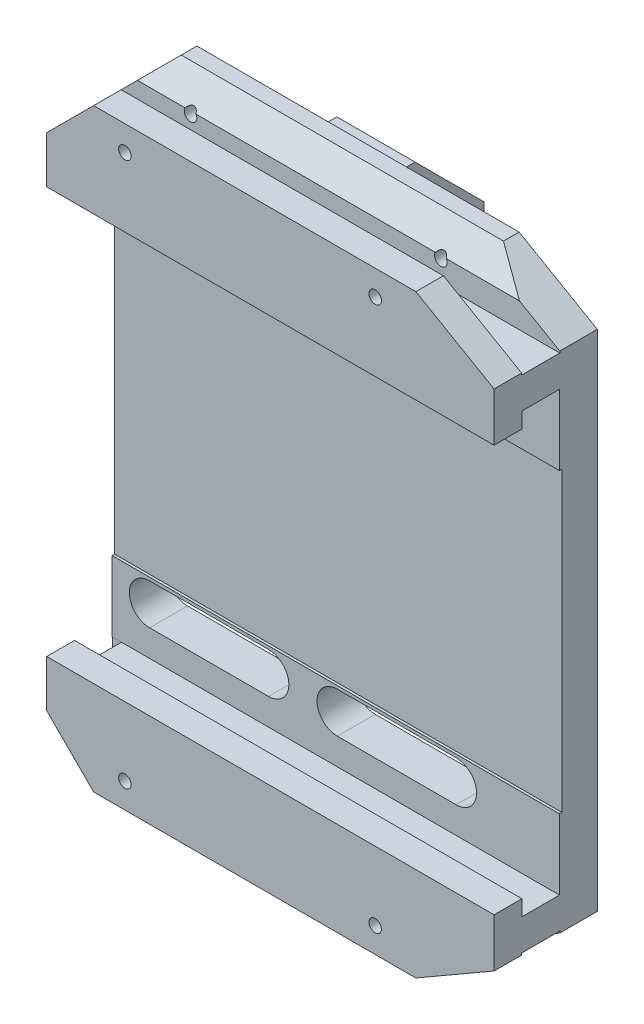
ISO-10303-21;
HEADER;
FILE_DESCRIPTION(('STEP AP214'),'2;1');
FILE_NAME('part.step','',(''),(''),'','','');
FILE_SCHEMA(('AUTOMOTIVE_DESIGN { 1 0 10303 214 1 1 1 1 }'));
ENDSEC;
DATA;
#1=APPLICATION_CONTEXT('core data for automotive mechanical design processes');
#2=APPLICATION_PROTOCOL_DEFINITION('international standard','automotive_design',2000,#1);
#3=PRODUCT_CONTEXT('',#1,'mechanical');
#4=PRODUCT('Part','Part','',(#3));
#5=PRODUCT_RELATED_PRODUCT_CATEGORY('part','',(#4));
#6=PRODUCT_DEFINITION_FORMATION('','',#4);
#7=PRODUCT_DEFINITION_CONTEXT('part definition',#1,'design');
#8=PRODUCT_DEFINITION('design','',#6,#7);
#9=PRODUCT_DEFINITION_SHAPE('','',#8);
#10=(LENGTH_UNIT() NAMED_UNIT(*) SI_UNIT(.MILLI.,.METRE.));
#11=(NAMED_UNIT(*) PLANE_ANGLE_UNIT() SI_UNIT($,.RADIAN.));
#12=(NAMED_UNIT(*) SI_UNIT($,.STERADIAN.) SOLID_ANGLE_UNIT());
#13=UNCERTAINTY_MEASURE_WITH_UNIT(LENGTH_MEASURE(1.E-05),#10,'distance_accuracy_value','');
#14=(GEOMETRIC_REPRESENTATION_CONTEXT(3) GLOBAL_UNCERTAINTY_ASSIGNED_CONTEXT((#13)) GLOBAL_UNIT_ASSIGNED_CONTEXT((#10,
#11,#12)) REPRESENTATION_CONTEXT('',''));
#15=CARTESIAN_POINT('',(0.,0.,0.));
#16=DIRECTION('',(0.,0.,1.));
#17=DIRECTION('',(1.,0.,0.));
#18=AXIS2_PLACEMENT_3D('',#15,#16,#17);
#19=CARTESIAN_POINT('',(-71.5,-95.,21.));
#20=DIRECTION('',(0.,0.,1.));
#21=DIRECTION('',(1.,0.,0.));
#22=AXIS2_PLACEMENT_3D('',#19,#20,#21);
#23=PLANE('',#22);
#24=CARTESIAN_POINT('',(-46.5000000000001,87.,21.));
#25=DIRECTION('',(0.,0.,-1.));
#26=DIRECTION('',(-1.,0.,0.));
#27=AXIS2_PLACEMENT_3D('',#24,#25,#26);
#28=CIRCLE('',#27,1.99999999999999);
#29=CARTESIAN_POINT('',(-48.5,87.,21.));
#30=VERTEX_POINT('',#29);
#31=EDGE_CURVE('E570',#30,#30,#28,.T.);
#32=ORIENTED_EDGE('',*,*,#31,.T.);
#33=EDGE_LOOP('',(#32));
#34=FACE_BOUND('',#33,.T.);
#35=DIRECTION('',(-1.,0.,0.));
#36=VECTOR('',#35,1.);
#37=CARTESIAN_POINT('',(-71.5,95.,21.));
#38=LINE('',#37,#36);
#39=CARTESIAN_POINT('',(46.5,95.,21.));
#40=VERTEX_POINT('',#39);
#41=CARTESIAN_POINT('',(-56.4999999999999,95.,21.));
#42=VERTEX_POINT('',#41);
#43=EDGE_CURVE('E1088',#40,#42,#38,.T.);
#44=ORIENTED_EDGE('',*,*,#43,.T.);
#45=DIRECTION('',(0.707106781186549,0.707106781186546,0.));
#46=VECTOR('',#45,1.);
#47=CARTESIAN_POINT('',(-159.,-7.49999999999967,21.));
#48=LINE('',#47,#46);
#49=CARTESIAN_POINT('',(-71.5,80.,21.));
#50=VERTEX_POINT('',#49);
#51=EDGE_CURVE('E873',#42,#50,#48,.F.);
#52=ORIENTED_EDGE('',*,*,#51,.T.);
#53=DIRECTION('',(0.,-1.,0.));
#54=VECTOR('',#53,1.);
#55=CARTESIAN_POINT('',(-71.5,95.,21.));
#56=LINE('',#55,#54);
#57=CARTESIAN_POINT('',(-71.5000000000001,65.,21.));
#58=VERTEX_POINT('',#57);
#59=EDGE_CURVE('E1079',#50,#58,#56,.T.);
#60=ORIENTED_EDGE('',*,*,#59,.T.);
#61=DIRECTION('',(1.,0.,0.));
#62=VECTOR('',#61,1.);
#63=CARTESIAN_POINT('',(-71.5000000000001,65.,21.));
#64=LINE('',#63,#62);
#65=CARTESIAN_POINT('',(71.5,65.,21.));
#66=VERTEX_POINT('',#65);
#67=EDGE_CURVE('E924',#58,#66,#64,.T.);
#68=ORIENTED_EDGE('',*,*,#67,.T.);
#69=DIRECTION('',(0.,1.,0.));
#70=VECTOR('',#69,1.);
#71=CARTESIAN_POINT('',(71.5,95.,21.));
#72=LINE('',#71,#70);
#73=CARTESIAN_POINT('',(71.5,80.5662432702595,21.));
#74=VERTEX_POINT('',#73);
#75=EDGE_CURVE('E1084',#66,#74,#72,.T.);
#76=ORIENTED_EDGE('',*,*,#75,.T.);
#77=DIRECTION('',(-0.866025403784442,0.499999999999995,0.));
#78=VECTOR('',#77,1.);
#79=CARTESIAN_POINT('',(71.5,80.5662432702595,21.));
#80=LINE('',#79,#78);
#81=EDGE_CURVE('E957',#74,#40,#80,.T.);
#82=ORIENTED_EDGE('',*,*,#81,.T.);
#83=EDGE_LOOP('',(#44,#52,#60,#68,#76,#82));
#84=FACE_BOUND('',#83,.T.);
#85=CARTESIAN_POINT('',(33.4999999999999,87.,21.));
#86=DIRECTION('',(0.,0.,-1.));
#87=DIRECTION('',(-1.,0.,0.));
#88=AXIS2_PLACEMENT_3D('',#85,#86,#87);
#89=CIRCLE('',#88,1.99999999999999);
#90=CARTESIAN_POINT('',(31.5,87.,21.));
#91=VERTEX_POINT('',#90);
#92=EDGE_CURVE('E594',#91,#91,#89,.T.);
#93=ORIENTED_EDGE('',*,*,#92,.T.);
#94=EDGE_LOOP('',(#93));
#95=FACE_BOUND('',#94,.T.);
#96=ADVANCED_FACE('F33',(#34,#84,#95),#23,.T.);
#97=CARTESIAN_POINT('',(-46.5000000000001,-87.,21.));
#98=DIRECTION('',(0.,0.,-1.));
#99=DIRECTION('',(-1.,0.,0.));
#100=AXIS2_PLACEMENT_3D('',#97,#98,#99);
#101=CIRCLE('',#100,1.99999999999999);
#102=CARTESIAN_POINT('',(-48.5,-87.,21.));
#103=VERTEX_POINT('',#102);
#104=EDGE_CURVE('E616',#103,#103,#101,.T.);
#105=ORIENTED_EDGE('',*,*,#104,.T.);
#106=EDGE_LOOP('',(#105));
#107=FACE_BOUND('',#106,.T.);
#108=CARTESIAN_POINT('',(-71.5,-65.,21.));
#109=VERTEX_POINT('',#108);
#110=CARTESIAN_POINT('',(-71.5,-79.9999999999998,21.));
#111=VERTEX_POINT('',#110);
#112=EDGE_CURVE('E1076',#109,#111,#56,.T.);
#113=ORIENTED_EDGE('',*,*,#112,.T.);
#114=DIRECTION('',(-0.707106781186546,0.70710678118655,0.));
#115=VECTOR('',#114,1.);
#116=CARTESIAN_POINT('',(-64.,-87.5,21.));
#117=LINE('',#116,#115);
#118=CARTESIAN_POINT('',(-56.5,-95.,21.));
#119=VERTEX_POINT('',#118);
#120=EDGE_CURVE('E885',#111,#119,#117,.F.);
#121=ORIENTED_EDGE('',*,*,#120,.T.);
#122=DIRECTION('',(1.,0.,0.));
#123=VECTOR('',#122,1.);
#124=CARTESIAN_POINT('',(-71.5,-95.,21.));
#125=LINE('',#124,#123);
#126=CARTESIAN_POINT('',(46.5,-95.,21.));
#127=VERTEX_POINT('',#126);
#128=EDGE_CURVE('E1082',#119,#127,#125,.T.);
#129=ORIENTED_EDGE('',*,*,#128,.T.);
#130=DIRECTION('',(0.866025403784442,0.499999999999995,0.));
#131=VECTOR('',#130,1.);
#132=CARTESIAN_POINT('',(71.5,-80.5662432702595,21.));
#133=LINE('',#132,#131);
#134=CARTESIAN_POINT('',(71.5,-80.5662432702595,21.));
#135=VERTEX_POINT('',#134);
#136=EDGE_CURVE('E940',#127,#135,#133,.T.);
#137=ORIENTED_EDGE('',*,*,#136,.T.);
#138=CARTESIAN_POINT('',(71.5,-65.,21.));
#139=VERTEX_POINT('',#138);
#140=EDGE_CURVE('E1085',#135,#139,#72,.T.);
#141=ORIENTED_EDGE('',*,*,#140,.T.);
#142=DIRECTION('',(1.,0.,0.));
#143=VECTOR('',#142,1.);
#144=CARTESIAN_POINT('',(-71.5,-65.,21.));
#145=LINE('',#144,#143);
#146=EDGE_CURVE('E925',#109,#139,#145,.T.);
#147=ORIENTED_EDGE('',*,*,#146,.F.);
#148=EDGE_LOOP('',(#113,#121,#129,#137,#141,#147));
#149=FACE_BOUND('',#148,.T.);
#150=CARTESIAN_POINT('',(33.4999999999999,-87.,21.));
#151=DIRECTION('',(0.,0.,-1.));
#152=DIRECTION('',(-1.,0.,0.));
#153=AXIS2_PLACEMENT_3D('',#150,#151,#152);
#154=CIRCLE('',#153,1.99999999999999);
#155=CARTESIAN_POINT('',(31.5,-87.,21.));
#156=VERTEX_POINT('',#155);
#157=EDGE_CURVE('E606',#156,#156,#154,.T.);
#158=ORIENTED_EDGE('',*,*,#157,.T.);
#159=EDGE_LOOP('',(#158));
#160=FACE_BOUND('',#159,.T.);
#161=ADVANCED_FACE('F1142',(#107,#149,#160),#23,.T.);
#162=CARTESIAN_POINT('',(-71.5,-95.,-12.));
#163=DIRECTION('',(0.,0.,1.));
#164=DIRECTION('',(1.,0.,0.));
#165=AXIS2_PLACEMENT_3D('',#162,#163,#164);
#166=PLANE('',#165);
#167=CARTESIAN_POINT('',(-46.5000000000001,87.,-12.));
#168=DIRECTION('',(0.,0.,-1.));
#169=DIRECTION('',(-1.,0.,0.));
#170=AXIS2_PLACEMENT_3D('',#167,#168,#169);
#171=CIRCLE('',#170,1.99999999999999);
#172=CARTESIAN_POINT('',(-48.5,87.,-12.));
#173=VERTEX_POINT('',#172);
#174=EDGE_CURVE('E587',#173,#173,#171,.T.);
#175=ORIENTED_EDGE('',*,*,#174,.F.);
#176=EDGE_LOOP('',(#175));
#177=FACE_BOUND('',#176,.T.);
#178=CARTESIAN_POINT('',(33.4999999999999,87.,-12.));
#179=DIRECTION('',(0.,0.,-1.));
#180=DIRECTION('',(-1.,0.,0.));
#181=AXIS2_PLACEMENT_3D('',#178,#179,#180);
#182=CIRCLE('',#181,1.99999999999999);
#183=CARTESIAN_POINT('',(31.5,87.,-12.));
#184=VERTEX_POINT('',#183);
#185=EDGE_CURVE('E597',#184,#184,#182,.T.);
#186=ORIENTED_EDGE('',*,*,#185,.F.);
#187=EDGE_LOOP('',(#186));
#188=FACE_BOUND('',#187,.T.);
#189=CARTESIAN_POINT('',(33.4999999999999,-87.,-12.));
#190=DIRECTION('',(0.,0.,-1.));
#191=DIRECTION('',(-1.,0.,0.));
#192=AXIS2_PLACEMENT_3D('',#189,#190,#191);
#193=CIRCLE('',#192,1.99999999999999);
#194=CARTESIAN_POINT('',(31.5,-87.,-12.));
#195=VERTEX_POINT('',#194);
#196=EDGE_CURVE('E609',#195,#195,#193,.T.);
#197=ORIENTED_EDGE('',*,*,#196,.F.);
#198=EDGE_LOOP('',(#197));
#199=FACE_BOUND('',#198,.T.);
#200=DIRECTION('',(-1.,0.,0.));
#201=VECTOR('',#200,1.);
#202=CARTESIAN_POINT('',(-46.5000000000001,-38.,-12.));
#203=LINE('',#202,#201);
#204=CARTESIAN_POINT('',(-36.5000000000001,-38.,-12.));
#205=VERTEX_POINT('',#204);
#206=CARTESIAN_POINT('',(-71.5000000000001,-38.,-12.));
#207=VERTEX_POINT('',#206);
#208=EDGE_CURVE('E722',#205,#207,#203,.T.);
#209=ORIENTED_EDGE('',*,*,#208,.F.);
#210=DIRECTION('',(0.,-1.,0.));
#211=VECTOR('',#210,1.);
#212=CARTESIAN_POINT('',(-36.5000000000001,38.,-12.));
#213=LINE('',#212,#211);
#214=CARTESIAN_POINT('',(-36.5000000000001,38.,-12.));
#215=VERTEX_POINT('',#214);
#216=EDGE_CURVE('E802',#205,#215,#213,.F.);
#217=ORIENTED_EDGE('',*,*,#216,.T.);
#218=DIRECTION('',(1.,0.,0.));
#219=VECTOR('',#218,1.);
#220=CARTESIAN_POINT('',(-46.5000000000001,38.,-12.));
#221=LINE('',#220,#219);
#222=CARTESIAN_POINT('',(-71.5,38.,-12.));
#223=VERTEX_POINT('',#222);
#224=EDGE_CURVE('E731',#223,#215,#221,.T.);
#225=ORIENTED_EDGE('',*,*,#224,.F.);
#226=DIRECTION('',(0.,-1.,0.));
#227=VECTOR('',#226,1.);
#228=CARTESIAN_POINT('',(-71.5,95.,-12.));
#229=LINE('',#228,#227);
#230=CARTESIAN_POINT('',(-71.5,80.,-12.));
#231=VERTEX_POINT('',#230);
#232=EDGE_CURVE('E828',#231,#223,#229,.T.);
#233=ORIENTED_EDGE('',*,*,#232,.F.);
#234=DIRECTION('',(-0.707106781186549,-0.707106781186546,0.));
#235=VECTOR('',#234,1.);
#236=CARTESIAN_POINT('',(-71.5,80.,-12.));
#237=LINE('',#236,#235);
#238=CARTESIAN_POINT('',(-56.5,95.,-12.));
#239=VERTEX_POINT('',#238);
#240=EDGE_CURVE('E856',#231,#239,#237,.F.);
#241=ORIENTED_EDGE('',*,*,#240,.T.);
#242=DIRECTION('',(-1.,0.,0.));
#243=VECTOR('',#242,1.);
#244=CARTESIAN_POINT('',(-71.5,95.,-12.));
#245=LINE('',#244,#243);
#246=CARTESIAN_POINT('',(46.5,95.,-12.));
#247=VERTEX_POINT('',#246);
#248=EDGE_CURVE('E1073',#247,#239,#245,.T.);
#249=ORIENTED_EDGE('',*,*,#248,.F.);
#250=DIRECTION('',(-0.866025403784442,0.499999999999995,0.));
#251=VECTOR('',#250,1.);
#252=CARTESIAN_POINT('',(71.5,80.5662432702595,-12.));
#253=LINE('',#252,#251);
#254=CARTESIAN_POINT('',(71.5,80.5662432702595,-12.));
#255=VERTEX_POINT('',#254);
#256=EDGE_CURVE('E954',#255,#247,#253,.T.);
#257=ORIENTED_EDGE('',*,*,#256,.F.);
#258=DIRECTION('',(0.,1.,0.));
#259=VECTOR('',#258,1.);
#260=CARTESIAN_POINT('',(71.5,95.,-12.));
#261=LINE('',#260,#259);
#262=CARTESIAN_POINT('',(71.5,-80.5662432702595,-12.));
#263=VERTEX_POINT('',#262);
#264=EDGE_CURVE('E1064',#263,#255,#261,.T.);
#265=ORIENTED_EDGE('',*,*,#264,.F.);
#266=DIRECTION('',(0.866025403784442,0.499999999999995,0.));
#267=VECTOR('',#266,1.);
#268=CARTESIAN_POINT('',(71.5,-80.5662432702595,-12.));
#269=LINE('',#268,#267);
#270=CARTESIAN_POINT('',(46.5,-95.,-12.));
#271=VERTEX_POINT('',#270);
#272=EDGE_CURVE('E937',#271,#263,#269,.T.);
#273=ORIENTED_EDGE('',*,*,#272,.F.);
#274=DIRECTION('',(1.,0.,0.));
#275=VECTOR('',#274,1.);
#276=CARTESIAN_POINT('',(-71.5,-95.,-12.));
#277=LINE('',#276,#275);
#278=CARTESIAN_POINT('',(-56.5,-95.,-12.));
#279=VERTEX_POINT('',#278);
#280=EDGE_CURVE('E831',#279,#271,#277,.T.);
#281=ORIENTED_EDGE('',*,*,#280,.F.);
#282=DIRECTION('',(0.707106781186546,-0.70710678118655,0.));
#283=VECTOR('',#282,1.);
#284=CARTESIAN_POINT('',(-56.5,-95.,-12.));
#285=LINE('',#284,#283);
#286=CARTESIAN_POINT('',(-71.5,-79.9999999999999,-12.));
#287=VERTEX_POINT('',#286);
#288=EDGE_CURVE('E824',#279,#287,#285,.F.);
#289=ORIENTED_EDGE('',*,*,#288,.T.);
#290=EDGE_CURVE('E732',#207,#287,#229,.T.);
#291=ORIENTED_EDGE('',*,*,#290,.F.);
#292=EDGE_LOOP('',(#209,#217,#225,#233,#241,#249,#257,#265,#273,#281,#289,#291));
#293=FACE_BOUND('',#292,.T.);
#294=DIRECTION('',(-1.,0.,0.));
#295=VECTOR('',#294,1.);
#296=CARTESIAN_POINT('',(-21.5,48.5,-12.));
#297=LINE('',#296,#295);
#298=CARTESIAN_POINT('',(-21.5,48.5,-12.));
#299=VERTEX_POINT('',#298);
#300=CARTESIAN_POINT('',(-59.5,48.5,-12.));
#301=VERTEX_POINT('',#300);
#302=EDGE_CURVE('E698',#299,#301,#297,.T.);
#303=ORIENTED_EDGE('',*,*,#302,.F.);
#304=CARTESIAN_POINT('',(-21.5,55.,-12.));
#305=DIRECTION('',(0.,0.,-1.));
#306=DIRECTION('',(-1.,0.,0.));
#307=AXIS2_PLACEMENT_3D('',#304,#305,#306);
#308=CIRCLE('',#307,6.50000000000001);
#309=CARTESIAN_POINT('',(-21.5000000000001,61.5,-12.));
#310=VERTEX_POINT('',#309);
#311=EDGE_CURVE('E690',#310,#299,#308,.T.);
#312=ORIENTED_EDGE('',*,*,#311,.F.);
#313=DIRECTION('',(1.,0.,0.));
#314=VECTOR('',#313,1.);
#315=CARTESIAN_POINT('',(-21.5000000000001,61.5,-12.));
#316=LINE('',#315,#314);
#317=CARTESIAN_POINT('',(-59.5,61.5,-12.));
#318=VERTEX_POINT('',#317);
#319=EDGE_CURVE('E704',#318,#310,#316,.T.);
#320=ORIENTED_EDGE('',*,*,#319,.F.);
#321=CARTESIAN_POINT('',(-59.5,55.,-12.));
#322=DIRECTION('',(0.,0.,-1.));
#323=DIRECTION('',(1.,0.,0.));
#324=AXIS2_PLACEMENT_3D('',#321,#322,#323);
#325=CIRCLE('',#324,6.50000000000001);
#326=EDGE_CURVE('E701',#301,#318,#325,.T.);
#327=ORIENTED_EDGE('',*,*,#326,.F.);
#328=EDGE_LOOP('',(#303,#312,#320,#327));
#329=FACE_BOUND('',#328,.T.);
#330=DIRECTION('',(-1.,0.,0.));
#331=VECTOR('',#330,1.);
#332=CARTESIAN_POINT('',(-21.5000000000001,-61.5,-12.));
#333=LINE('',#332,#331);
#334=CARTESIAN_POINT('',(-21.5000000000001,-61.5,-12.));
#335=VERTEX_POINT('',#334);
#336=CARTESIAN_POINT('',(-59.5,-61.5,-12.));
#337=VERTEX_POINT('',#336);
#338=EDGE_CURVE('E680',#335,#337,#333,.T.);
#339=ORIENTED_EDGE('',*,*,#338,.F.);
#340=CARTESIAN_POINT('',(-21.5,-55.,-12.));
#341=DIRECTION('',(0.,0.,-1.));
#342=DIRECTION('',(1.,0.,0.));
#343=AXIS2_PLACEMENT_3D('',#340,#341,#342);
#344=CIRCLE('',#343,6.50000000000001);
#345=CARTESIAN_POINT('',(-21.5,-48.5,-12.));
#346=VERTEX_POINT('',#345);
#347=EDGE_CURVE('E672',#346,#335,#344,.T.);
#348=ORIENTED_EDGE('',*,*,#347,.F.);
#349=DIRECTION('',(1.,0.,0.));
#350=VECTOR('',#349,1.);
#351=CARTESIAN_POINT('',(-21.5,-48.5,-12.));
#352=LINE('',#351,#350);
#353=CARTESIAN_POINT('',(-59.5,-48.5,-12.));
#354=VERTEX_POINT('',#353);
#355=EDGE_CURVE('E686',#354,#346,#352,.T.);
#356=ORIENTED_EDGE('',*,*,#355,.F.);
#357=CARTESIAN_POINT('',(-59.5,-55.,-12.));
#358=DIRECTION('',(0.,0.,-1.));
#359=DIRECTION('',(1.,0.,0.));
#360=AXIS2_PLACEMENT_3D('',#357,#358,#359);
#361=CIRCLE('',#360,6.50000000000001);
#362=EDGE_CURVE('E683',#337,#354,#361,.T.);
#363=ORIENTED_EDGE('',*,*,#362,.F.);
#364=EDGE_LOOP('',(#339,#348,#356,#363));
#365=FACE_BOUND('',#364,.T.);
#366=DIRECTION('',(-1.,0.,0.));
#367=VECTOR('',#366,1.);
#368=CARTESIAN_POINT('',(38.5,48.5,-12.));
#369=LINE('',#368,#367);
#370=CARTESIAN_POINT('',(38.5,48.5,-12.));
#371=VERTEX_POINT('',#370);
#372=CARTESIAN_POINT('',(0.499999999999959,48.5,-12.));
#373=VERTEX_POINT('',#372);
#374=EDGE_CURVE('E660',#371,#373,#369,.T.);
#375=ORIENTED_EDGE('',*,*,#374,.F.);
#376=CARTESIAN_POINT('',(38.5,55.,-12.));
#377=DIRECTION('',(0.,0.,-1.));
#378=DIRECTION('',(-1.,0.,0.));
#379=AXIS2_PLACEMENT_3D('',#376,#377,#378);
#380=CIRCLE('',#379,6.50000000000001);
#381=CARTESIAN_POINT('',(38.5,61.5,-12.));
#382=VERTEX_POINT('',#381);
#383=EDGE_CURVE('E655',#382,#371,#380,.T.);
#384=ORIENTED_EDGE('',*,*,#383,.F.);
#385=DIRECTION('',(1.,0.,0.));
#386=VECTOR('',#385,1.);
#387=CARTESIAN_POINT('',(38.5,61.5,-12.));
#388=LINE('',#387,#386);
#389=CARTESIAN_POINT('',(0.499999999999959,61.5,-12.));
#390=VERTEX_POINT('',#389);
#391=EDGE_CURVE('E666',#390,#382,#388,.T.);
#392=ORIENTED_EDGE('',*,*,#391,.F.);
#393=CARTESIAN_POINT('',(0.499999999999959,55.,-12.));
#394=DIRECTION('',(0.,0.,-1.));
#395=DIRECTION('',(1.,0.,0.));
#396=AXIS2_PLACEMENT_3D('',#393,#394,#395);
#397=CIRCLE('',#396,6.50000000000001);
#398=EDGE_CURVE('E663',#373,#390,#397,.T.);
#399=ORIENTED_EDGE('',*,*,#398,.F.);
#400=EDGE_LOOP('',(#375,#384,#392,#399));
#401=FACE_BOUND('',#400,.T.);
#402=DIRECTION('',(-1.,0.,0.));
#403=VECTOR('',#402,1.);
#404=CARTESIAN_POINT('',(38.5,-61.5,-12.));
#405=LINE('',#404,#403);
#406=CARTESIAN_POINT('',(38.5,-61.5,-12.));
#407=VERTEX_POINT('',#406);
#408=CARTESIAN_POINT('',(0.499999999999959,-61.5,-12.));
#409=VERTEX_POINT('',#408);
#410=EDGE_CURVE('E646',#407,#409,#405,.T.);
#411=ORIENTED_EDGE('',*,*,#410,.F.);
#412=CARTESIAN_POINT('',(38.5,-55.,-12.));
#413=DIRECTION('',(0.,0.,-1.));
#414=DIRECTION('',(1.,0.,0.));
#415=AXIS2_PLACEMENT_3D('',#412,#413,#414);
#416=CIRCLE('',#415,6.50000000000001);
#417=CARTESIAN_POINT('',(38.5,-48.5,-12.));
#418=VERTEX_POINT('',#417);
#419=EDGE_CURVE('E459',#418,#407,#416,.T.);
#420=ORIENTED_EDGE('',*,*,#419,.F.);
#421=DIRECTION('',(1.,0.,0.));
#422=VECTOR('',#421,1.);
#423=CARTESIAN_POINT('',(38.5,-48.5,-12.));
#424=LINE('',#423,#422);
#425=CARTESIAN_POINT('',(0.499999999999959,-48.5,-12.));
#426=VERTEX_POINT('',#425);
#427=EDGE_CURVE('E461',#426,#418,#424,.T.);
#428=ORIENTED_EDGE('',*,*,#427,.F.);
#429=CARTESIAN_POINT('',(0.499999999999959,-55.,-12.));
#430=DIRECTION('',(0.,0.,-1.));
#431=DIRECTION('',(1.,0.,0.));
#432=AXIS2_PLACEMENT_3D('',#429,#430,#431);
#433=CIRCLE('',#432,6.50000000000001);
#434=EDGE_CURVE('E648',#409,#426,#433,.T.);
#435=ORIENTED_EDGE('',*,*,#434,.F.);
#436=EDGE_LOOP('',(#411,#420,#428,#435));
#437=FACE_BOUND('',#436,.T.);
#438=CARTESIAN_POINT('',(-46.5000000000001,-87.,-12.));
#439=DIRECTION('',(0.,0.,-1.));
#440=DIRECTION('',(-1.,0.,0.));
#441=AXIS2_PLACEMENT_3D('',#438,#439,#440);
#442=CIRCLE('',#441,1.99999999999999);
#443=CARTESIAN_POINT('',(-48.5,-87.,-12.));
#444=VERTEX_POINT('',#443);
#445=EDGE_CURVE('E619',#444,#444,#442,.T.);
#446=ORIENTED_EDGE('',*,*,#445,.F.);
#447=EDGE_LOOP('',(#446));
#448=FACE_BOUND('',#447,.T.);
#449=ADVANCED_FACE('F817',(#177,#188,#199,#293,#329,#365,#401,#437,#448),#166,.F.);
#450=CARTESIAN_POINT('',(-71.5,-80.,0.));
#451=DIRECTION('',(0.,0.,1.));
#452=DIRECTION('',(1.,0.,0.));
#453=AXIS2_PLACEMENT_3D('',#450,#451,#452);
#454=PLANE('',#453);
#455=DIRECTION('',(-1.,0.,0.));
#456=VECTOR('',#455,1.);
#457=CARTESIAN_POINT('',(94.0002222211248,70.,0.));
#458=LINE('',#457,#456);
#459=CARTESIAN_POINT('',(-68.5,70.,0.));
#460=VERTEX_POINT('',#459);
#461=CARTESIAN_POINT('',(-71.5,70.,0.));
#462=VERTEX_POINT('',#461);
#463=EDGE_CURVE('E577',#460,#462,#458,.T.);
#464=ORIENTED_EDGE('',*,*,#463,.F.);
#465=DIRECTION('',(0.,1.,0.));
#466=VECTOR('',#465,1.);
#467=CARTESIAN_POINT('',(-68.5,80.,0.));
#468=LINE('',#467,#466);
#469=CARTESIAN_POINT('',(-68.5,80.,0.));
#470=VERTEX_POINT('',#469);
#471=EDGE_CURVE('E978',#460,#470,#468,.T.);
#472=ORIENTED_EDGE('',*,*,#471,.T.);
#473=DIRECTION('',(1.,0.,0.));
#474=VECTOR('',#473,1.);
#475=CARTESIAN_POINT('',(71.4999999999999,80.,0.));
#476=LINE('',#475,#474);
#477=CARTESIAN_POINT('',(71.4999999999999,80.,0.));
#478=VERTEX_POINT('',#477);
#479=EDGE_CURVE('E982',#470,#478,#476,.T.);
#480=ORIENTED_EDGE('',*,*,#479,.T.);
#481=DIRECTION('',(0.,1.,0.));
#482=VECTOR('',#481,1.);
#483=CARTESIAN_POINT('',(71.4999999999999,80.,0.));
#484=LINE('',#483,#482);
#485=CARTESIAN_POINT('',(71.5,80.5662432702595,0.));
#486=VERTEX_POINT('',#485);
#487=EDGE_CURVE('E984',#478,#486,#484,.T.);
#488=ORIENTED_EDGE('',*,*,#487,.T.);
#489=DIRECTION('',(0.866025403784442,-0.499999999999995,0.));
#490=VECTOR('',#489,1.);
#491=CARTESIAN_POINT('',(33.7772228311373,102.345498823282,0.));
#492=LINE('',#491,#490);
#493=CARTESIAN_POINT('',(58.6243556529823,87.9999999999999,0.));
#494=VERTEX_POINT('',#493);
#495=EDGE_CURVE('E1070',#494,#486,#492,.T.);
#496=ORIENTED_EDGE('',*,*,#495,.F.);
#497=DIRECTION('',(-1.,0.,0.));
#498=VECTOR('',#497,1.);
#499=CARTESIAN_POINT('',(-56.4999999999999,87.9999999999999,0.));
#500=LINE('',#499,#498);
#501=CARTESIAN_POINT('',(35.2320508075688,87.9999999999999,0.));
#502=VERTEX_POINT('',#501);
#503=EDGE_CURVE('E769',#494,#502,#500,.T.);
#504=ORIENTED_EDGE('',*,*,#503,.T.);
#505=CARTESIAN_POINT('',(33.4999999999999,87.,0.));
#506=DIRECTION('',(0.,0.,1.));
#507=DIRECTION('',(1.,0.,0.));
#508=AXIS2_PLACEMENT_3D('',#505,#506,#507);
#509=CIRCLE('',#508,1.99999999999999);
#510=CARTESIAN_POINT('',(31.767949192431,87.9999999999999,0.));
#511=VERTEX_POINT('',#510);
#512=EDGE_CURVE('E600',#511,#502,#509,.T.);
#513=ORIENTED_EDGE('',*,*,#512,.F.);
#514=DIRECTION('',(-1.,0.,0.));
#515=VECTOR('',#514,1.);
#516=CARTESIAN_POINT('',(-56.4999999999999,87.9999999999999,0.));
#517=LINE('',#516,#515);
#518=CARTESIAN_POINT('',(-44.7679491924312,87.9999999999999,0.));
#519=VERTEX_POINT('',#518);
#520=EDGE_CURVE('E767',#511,#519,#517,.T.);
#521=ORIENTED_EDGE('',*,*,#520,.T.);
#522=CARTESIAN_POINT('',(-46.5000000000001,87.,0.));
#523=DIRECTION('',(0.,0.,1.));
#524=DIRECTION('',(1.,0.,0.));
#525=AXIS2_PLACEMENT_3D('',#522,#523,#524);
#526=CIRCLE('',#525,1.99999999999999);
#527=CARTESIAN_POINT('',(-48.232050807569,87.9999999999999,0.));
#528=VERTEX_POINT('',#527);
#529=EDGE_CURVE('E590',#528,#519,#526,.T.);
#530=ORIENTED_EDGE('',*,*,#529,.F.);
#531=DIRECTION('',(-1.,0.,0.));
#532=VECTOR('',#531,1.);
#533=CARTESIAN_POINT('',(-56.4999999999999,87.9999999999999,0.));
#534=LINE('',#533,#532);
#535=CARTESIAN_POINT('',(-63.5000000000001,87.9999999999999,0.));
#536=VERTEX_POINT('',#535);
#537=EDGE_CURVE('E759',#528,#536,#534,.T.);
#538=ORIENTED_EDGE('',*,*,#537,.T.);
#539=DIRECTION('',(0.707106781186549,0.707106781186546,0.));
#540=VECTOR('',#539,1.);
#541=CARTESIAN_POINT('',(-151.5,2.91433543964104E-13,0.));
#542=LINE('',#541,#540);
#543=CARTESIAN_POINT('',(-71.5,80.,0.));
#544=VERTEX_POINT('',#543);
#545=EDGE_CURVE('E864',#536,#544,#542,.F.);
#546=ORIENTED_EDGE('',*,*,#545,.T.);
#547=DIRECTION('',(0.,-1.,0.));
#548=VECTOR('',#547,1.);
#549=CARTESIAN_POINT('',(-71.5,95.,0.));
#550=LINE('',#549,#548);
#551=EDGE_CURVE('E971',#544,#462,#550,.T.);
#552=ORIENTED_EDGE('',*,*,#551,.T.);
#553=EDGE_LOOP('',(#464,#472,#480,#488,#496,#504,#513,#521,#530,#538,#546,#552));
#554=FACE_BOUND('',#553,.T.);
#555=ADVANCED_FACE('F1026',(#554),#454,.T.);
#556=CARTESIAN_POINT('',(-71.5,95.,21.));
#557=DIRECTION('',(1.,0.,0.));
#558=DIRECTION('',(0.,1.,0.));
#559=AXIS2_PLACEMENT_3D('',#556,#557,#558);
#560=PLANE('',#559);
#561=DIRECTION('',(0.,0.,-1.));
#562=VECTOR('',#561,1.);
#563=CARTESIAN_POINT('',(-71.5,-65.,21.));
#564=LINE('',#563,#562);
#565=CARTESIAN_POINT('',(-71.5,-65.,12.1));
#566=VERTEX_POINT('',#565);
#567=EDGE_CURVE('E922',#109,#566,#564,.T.);
#568=ORIENTED_EDGE('',*,*,#567,.T.);
#569=DIRECTION('',(0.,-1.,0.));
#570=VECTOR('',#569,1.);
#571=CARTESIAN_POINT('',(-71.5,-70.,12.1));
#572=LINE('',#571,#570);
#573=CARTESIAN_POINT('',(-71.5,-70.,12.1));
#574=VERTEX_POINT('',#573);
#575=EDGE_CURVE('E547',#566,#574,#572,.T.);
#576=ORIENTED_EDGE('',*,*,#575,.T.);
#577=DIRECTION('',(0.,0.,1.));
#578=VECTOR('',#577,1.);
#579=CARTESIAN_POINT('',(-71.5,-70.,12.1));
#580=LINE('',#579,#578);
#581=CARTESIAN_POINT('',(-71.5,-70.,12.2));
#582=VERTEX_POINT('',#581);
#583=EDGE_CURVE('E555',#574,#582,#580,.T.);
#584=ORIENTED_EDGE('',*,*,#583,.T.);
#585=DIRECTION('',(0.,-1.,0.));
#586=VECTOR('',#585,1.);
#587=CARTESIAN_POINT('',(-71.5,95.,12.2));
#588=LINE('',#587,#586);
#589=CARTESIAN_POINT('',(-71.5,-79.9999999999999,12.2));
#590=VERTEX_POINT('',#589);
#591=EDGE_CURVE('E987',#582,#590,#588,.T.);
#592=ORIENTED_EDGE('',*,*,#591,.T.);
#593=DIRECTION('',(0.,0.,1.));
#594=VECTOR('',#593,1.);
#595=CARTESIAN_POINT('',(-71.5,-79.9999999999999,21.));
#596=LINE('',#595,#594);
#597=EDGE_CURVE('E883',#590,#111,#596,.T.);
#598=ORIENTED_EDGE('',*,*,#597,.T.);
#599=ORIENTED_EDGE('',*,*,#112,.F.);
#600=EDGE_LOOP('',(#568,#576,#584,#592,#598,#599));
#601=FACE_BOUND('',#600,.T.);
#602=ADVANCED_FACE('F1149',(#601),#560,.F.);
#603=CARTESIAN_POINT('',(-68.5,80.,12.2));
#604=DIRECTION('',(-1.,0.,0.));
#605=DIRECTION('',(0.,-1.,0.));
#606=AXIS2_PLACEMENT_3D('',#603,#604,#605);
#607=PLANE('',#606);
#608=DIRECTION('',(0.,0.,-1.));
#609=VECTOR('',#608,1.);
#610=CARTESIAN_POINT('',(-68.5,70.,12.2));
#611=LINE('',#610,#609);
#612=CARTESIAN_POINT('',(-68.5,70.,12.2));
#613=VERTEX_POINT('',#612);
#614=CARTESIAN_POINT('',(-68.5,70.,12.1));
#615=VERTEX_POINT('',#614);
#616=EDGE_CURVE('E934',#613,#615,#611,.T.);
#617=ORIENTED_EDGE('',*,*,#616,.F.);
#618=DIRECTION('',(0.,1.,0.));
#619=VECTOR('',#618,1.);
#620=CARTESIAN_POINT('',(-68.5,80.,12.2));
#621=LINE('',#620,#619);
#622=CARTESIAN_POINT('',(-68.5,80.,12.2));
#623=VERTEX_POINT('',#622);
#624=EDGE_CURVE('E997',#613,#623,#621,.T.);
#625=ORIENTED_EDGE('',*,*,#624,.T.);
#626=DIRECTION('',(0.,0.,-1.));
#627=VECTOR('',#626,1.);
#628=CARTESIAN_POINT('',(-68.5,80.,12.2));
#629=LINE('',#628,#627);
#630=EDGE_CURVE('E840',#623,#470,#629,.T.);
#631=ORIENTED_EDGE('',*,*,#630,.T.);
#632=ORIENTED_EDGE('',*,*,#471,.F.);
#633=CARTESIAN_POINT('',(-68.5,70.,0.0999999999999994));
#634=VERTEX_POINT('',#633);
#635=EDGE_CURVE('E932',#634,#460,#611,.T.);
#636=ORIENTED_EDGE('',*,*,#635,.F.);
#637=EDGE_CURVE('E938',#615,#634,#611,.T.);
#638=ORIENTED_EDGE('',*,*,#637,.F.);
#639=EDGE_LOOP('',(#617,#625,#631,#632,#636,#638));
#640=FACE_BOUND('',#639,.T.);
#641=ADVANCED_FACE('F1016',(#640),#607,.T.);
#642=CARTESIAN_POINT('',(-71.5,-80.,12.2));
#643=DIRECTION('',(0.,0.,1.));
#644=DIRECTION('',(1.,0.,0.));
#645=AXIS2_PLACEMENT_3D('',#642,#643,#644);
#646=PLANE('',#645);
#647=CARTESIAN_POINT('',(-46.5000000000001,87.,12.2));
#648=DIRECTION('',(0.,0.,1.));
#649=DIRECTION('',(1.,0.,0.));
#650=AXIS2_PLACEMENT_3D('',#647,#648,#649);
#651=CIRCLE('',#650,1.99999999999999);
#652=CARTESIAN_POINT('',(-44.5000000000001,87.,12.2));
#653=VERTEX_POINT('',#652);
#654=EDGE_CURVE('E591',#653,#653,#651,.T.);
#655=ORIENTED_EDGE('',*,*,#654,.T.);
#656=EDGE_LOOP('',(#655));
#657=FACE_BOUND('',#656,.T.);
#658=CARTESIAN_POINT('',(33.4999999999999,87.,12.2));
#659=DIRECTION('',(0.,0.,1.));
#660=DIRECTION('',(1.,0.,0.));
#661=AXIS2_PLACEMENT_3D('',#658,#659,#660);
#662=CIRCLE('',#661,1.99999999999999);
#663=CARTESIAN_POINT('',(35.4999999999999,87.,12.2));
#664=VERTEX_POINT('',#663);
#665=EDGE_CURVE('E603',#664,#664,#662,.T.);
#666=ORIENTED_EDGE('',*,*,#665,.T.);
#667=EDGE_LOOP('',(#666));
#668=FACE_BOUND('',#667,.T.);
#669=ORIENTED_EDGE('',*,*,#624,.F.);
#670=DIRECTION('',(-1.,0.,0.));
#671=VECTOR('',#670,1.);
#672=CARTESIAN_POINT('',(94.0002222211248,70.,12.2));
#673=LINE('',#672,#671);
#674=CARTESIAN_POINT('',(-71.5,70.,12.2));
#675=VERTEX_POINT('',#674);
#676=EDGE_CURVE('E537',#613,#675,#673,.T.);
#677=ORIENTED_EDGE('',*,*,#676,.T.);
#678=CARTESIAN_POINT('',(-71.5,80.,12.2));
#679=VERTEX_POINT('',#678);
#680=EDGE_CURVE('E988',#679,#675,#588,.T.);
#681=ORIENTED_EDGE('',*,*,#680,.F.);
#682=DIRECTION('',(-0.707106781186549,-0.707106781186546,0.));
#683=VECTOR('',#682,1.);
#684=CARTESIAN_POINT('',(-71.5,80.,12.2));
#685=LINE('',#684,#683);
#686=CARTESIAN_POINT('',(-56.4999999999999,95.,12.2));
#687=VERTEX_POINT('',#686);
#688=EDGE_CURVE('E869',#679,#687,#685,.F.);
#689=ORIENTED_EDGE('',*,*,#688,.T.);
#690=DIRECTION('',(-1.,0.,0.));
#691=VECTOR('',#690,1.);
#692=CARTESIAN_POINT('',(71.5,95.,12.2));
#693=LINE('',#692,#691);
#694=CARTESIAN_POINT('',(46.5,95.,12.2));
#695=VERTEX_POINT('',#694);
#696=EDGE_CURVE('E1006',#695,#687,#693,.T.);
#697=ORIENTED_EDGE('',*,*,#696,.F.);
#698=DIRECTION('',(0.866025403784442,-0.499999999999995,0.));
#699=VECTOR('',#698,1.);
#700=CARTESIAN_POINT('',(33.7772228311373,102.345498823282,12.2));
#701=LINE('',#700,#699);
#702=CARTESIAN_POINT('',(71.5,80.5662432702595,12.2));
#703=VERTEX_POINT('',#702);
#704=EDGE_CURVE('E964',#695,#703,#701,.T.);
#705=ORIENTED_EDGE('',*,*,#704,.T.);
#706=DIRECTION('',(0.,1.,0.));
#707=VECTOR('',#706,1.);
#708=CARTESIAN_POINT('',(71.4999999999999,80.,12.2));
#709=LINE('',#708,#707);
#710=CARTESIAN_POINT('',(71.4999999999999,80.,12.2));
#711=VERTEX_POINT('',#710);
#712=EDGE_CURVE('E1003',#711,#703,#709,.T.);
#713=ORIENTED_EDGE('',*,*,#712,.F.);
#714=DIRECTION('',(1.,0.,0.));
#715=VECTOR('',#714,1.);
#716=CARTESIAN_POINT('',(71.4999999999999,80.,12.2));
#717=LINE('',#716,#715);
#718=EDGE_CURVE('E1001',#623,#711,#717,.T.);
#719=ORIENTED_EDGE('',*,*,#718,.F.);
#720=EDGE_LOOP('',(#669,#677,#681,#689,#697,#705,#713,#719));
#721=FACE_BOUND('',#720,.T.);
#722=ADVANCED_FACE('F1054',(#657,#668,#721),#646,.F.);
#723=CARTESIAN_POINT('',(-71.5,0.,-55.75));
#724=DIRECTION('',(1.,0.,0.));
#725=DIRECTION('',(0.,1.,0.));
#726=AXIS2_PLACEMENT_3D('',#723,#724,#725);
#727=CIRCLE('',#726,12.5);
#728=CARTESIAN_POINT('',(-71.5,12.5,-55.75));
#729=VERTEX_POINT('',#728);
#730=EDGE_CURVE('E719',#729,#729,#727,.F.);
#731=ORIENTED_EDGE('',*,*,#730,.F.);
#732=EDGE_LOOP('',(#731));
#733=FACE_BOUND('',#732,.T.);
#734=DIRECTION('',(0.,-1.,0.));
#735=VECTOR('',#734,1.);
#736=CARTESIAN_POINT('',(-71.5,47.5,-0.7));
#737=LINE('',#736,#735);
#738=CARTESIAN_POINT('',(-71.5,47.5,-0.7));
#739=VERTEX_POINT('',#738);
#740=CARTESIAN_POINT('',(-71.5,-47.5,-0.7));
#741=VERTEX_POINT('',#740);
#742=EDGE_CURVE('E626',#739,#741,#737,.T.);
#743=ORIENTED_EDGE('',*,*,#742,.F.);
#744=DIRECTION('',(0.,0.,1.));
#745=VECTOR('',#744,1.);
#746=CARTESIAN_POINT('',(-71.5,47.5,-0.7));
#747=LINE('',#746,#745);
#748=CARTESIAN_POINT('',(-71.5,47.5,0.100000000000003));
#749=VERTEX_POINT('',#748);
#750=EDGE_CURVE('E638',#739,#749,#747,.T.);
#751=ORIENTED_EDGE('',*,*,#750,.T.);
#752=DIRECTION('',(0.,1.,0.));
#753=VECTOR('',#752,1.);
#754=CARTESIAN_POINT('',(-71.5,70.,0.0999999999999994));
#755=LINE('',#754,#753);
#756=CARTESIAN_POINT('',(-71.5,70.,0.0999999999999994));
#757=VERTEX_POINT('',#756);
#758=EDGE_CURVE('E574',#749,#757,#755,.T.);
#759=ORIENTED_EDGE('',*,*,#758,.T.);
#760=DIRECTION('',(0.,0.,-1.));
#761=VECTOR('',#760,1.);
#762=CARTESIAN_POINT('',(-71.5,70.,0.));
#763=LINE('',#762,#761);
#764=EDGE_CURVE('E551',#757,#462,#763,.T.);
#765=ORIENTED_EDGE('',*,*,#764,.T.);
#766=ORIENTED_EDGE('',*,*,#551,.F.);
#767=DIRECTION('',(0.,0.,-1.));
#768=VECTOR('',#767,1.);
#769=CARTESIAN_POINT('',(-71.5,80.,21.));
#770=LINE('',#769,#768);
#771=EDGE_CURVE('E851',#544,#231,#770,.T.);
#772=ORIENTED_EDGE('',*,*,#771,.T.);
#773=ORIENTED_EDGE('',*,*,#232,.T.);
#774=DIRECTION('',(0.,0.,1.));
#775=VECTOR('',#774,1.);
#776=CARTESIAN_POINT('',(-71.5000000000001,38.,-93.75));
#777=LINE('',#776,#775);
#778=CARTESIAN_POINT('',(-71.5,38.,-71.7499999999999));
#779=VERTEX_POINT('',#778);
#780=EDGE_CURVE('E743',#779,#223,#777,.T.);
#781=ORIENTED_EDGE('',*,*,#780,.F.);
#782=DIRECTION('',(0.,-0.707106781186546,-0.707106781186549));
#783=VECTOR('',#782,1.);
#784=CARTESIAN_POINT('',(-71.5,16.,-93.75));
#785=LINE('',#784,#783);
#786=CARTESIAN_POINT('',(-71.5,16.,-93.75));
#787=VERTEX_POINT('',#786);
#788=EDGE_CURVE('E746',#779,#787,#785,.T.);
#789=ORIENTED_EDGE('',*,*,#788,.T.);
#790=DIRECTION('',(0.,1.,0.));
#791=VECTOR('',#790,1.);
#792=CARTESIAN_POINT('',(-71.5000000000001,38.,-93.75));
#793=LINE('',#792,#791);
#794=CARTESIAN_POINT('',(-71.5,-16.,-93.75));
#795=VERTEX_POINT('',#794);
#796=EDGE_CURVE('E896',#795,#787,#793,.T.);
#797=ORIENTED_EDGE('',*,*,#796,.F.);
#798=DIRECTION('',(0.,-0.707106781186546,0.707106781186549));
#799=VECTOR('',#798,1.);
#800=CARTESIAN_POINT('',(-71.5,-16.,-93.75));
#801=LINE('',#800,#799);
#802=CARTESIAN_POINT('',(-71.5000000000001,-38.,-71.7499999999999));
#803=VERTEX_POINT('',#802);
#804=EDGE_CURVE('E748',#795,#803,#801,.T.);
#805=ORIENTED_EDGE('',*,*,#804,.T.);
#806=DIRECTION('',(0.,0.,1.));
#807=VECTOR('',#806,1.);
#808=CARTESIAN_POINT('',(-71.5000000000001,-38.,-93.75));
#809=LINE('',#808,#807);
#810=EDGE_CURVE('E739',#803,#207,#809,.T.);
#811=ORIENTED_EDGE('',*,*,#810,.T.);
#812=ORIENTED_EDGE('',*,*,#290,.T.);
#813=DIRECTION('',(0.,0.,1.));
#814=VECTOR('',#813,1.);
#815=CARTESIAN_POINT('',(-71.5,-79.9999999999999,21.));
#816=LINE('',#815,#814);
#817=CARTESIAN_POINT('',(-71.5,-79.9999999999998,0.));
#818=VERTEX_POINT('',#817);
#819=EDGE_CURVE('E849',#287,#818,#816,.T.);
#820=ORIENTED_EDGE('',*,*,#819,.T.);
#821=CARTESIAN_POINT('',(-71.5,-70.,0.));
#822=VERTEX_POINT('',#821);
#823=EDGE_CURVE('E970',#822,#818,#550,.T.);
#824=ORIENTED_EDGE('',*,*,#823,.F.);
#825=DIRECTION('',(0.,0.,1.));
#826=VECTOR('',#825,1.);
#827=CARTESIAN_POINT('',(-71.5,-70.,0.));
#828=LINE('',#827,#826);
#829=CARTESIAN_POINT('',(-71.5,-70.,0.0999999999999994));
#830=VERTEX_POINT('',#829);
#831=EDGE_CURVE('E512',#822,#830,#828,.T.);
#832=ORIENTED_EDGE('',*,*,#831,.T.);
#833=DIRECTION('',(0.,1.,0.));
#834=VECTOR('',#833,1.);
#835=CARTESIAN_POINT('',(-71.5,-70.,0.0999999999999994));
#836=LINE('',#835,#834);
#837=CARTESIAN_POINT('',(-71.5,-47.5,0.100000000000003));
#838=VERTEX_POINT('',#837);
#839=EDGE_CURVE('E519',#830,#838,#836,.T.);
#840=ORIENTED_EDGE('',*,*,#839,.T.);
#841=DIRECTION('',(0.,0.,1.));
#842=VECTOR('',#841,1.);
#843=CARTESIAN_POINT('',(-71.5,-47.5,-0.7));
#844=LINE('',#843,#842);
#845=EDGE_CURVE('E637',#741,#838,#844,.T.);
#846=ORIENTED_EDGE('',*,*,#845,.F.);
#847=EDGE_LOOP('',(#743,#751,#759,#765,#766,#772,#773,#781,#789,#797,#805,#811,#812,#820,#824,
#832,#840,#846));
#848=FACE_BOUND('',#847,.T.);
#849=ADVANCED_FACE('F902',(#733,#848),#560,.F.);
#850=CARTESIAN_POINT('',(-71.5,-95.,21.));
#851=DIRECTION('',(0.,1.,0.));
#852=DIRECTION('',(0.,0.,1.));
#853=AXIS2_PLACEMENT_3D('',#850,#851,#852);
#854=PLANE('',#853);
#855=DIRECTION('',(0.,0.,-1.));
#856=VECTOR('',#855,1.);
#857=CARTESIAN_POINT('',(46.5,-95.,21.));
#858=LINE('',#857,#856);
#859=CARTESIAN_POINT('',(46.5,-95.,-7.00000000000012));
#860=VERTEX_POINT('',#859);
#861=EDGE_CURVE('E943',#860,#271,#858,.T.);
#862=ORIENTED_EDGE('',*,*,#861,.F.);
#863=DIRECTION('',(-1.,0.,0.));
#864=VECTOR('',#863,1.);
#865=CARTESIAN_POINT('',(-56.5,-95.,-7.00000000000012));
#866=LINE('',#865,#864);
#867=CARTESIAN_POINT('',(-56.5,-95.,-7.00000000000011));
#868=VERTEX_POINT('',#867);
#869=EDGE_CURVE('E795',#860,#868,#866,.T.);
#870=ORIENTED_EDGE('',*,*,#869,.T.);
#871=DIRECTION('',(0.,0.,-1.));
#872=VECTOR('',#871,1.);
#873=CARTESIAN_POINT('',(-56.5,-95.,21.));
#874=LINE('',#873,#872);
#875=EDGE_CURVE('E875',#868,#279,#874,.T.);
#876=ORIENTED_EDGE('',*,*,#875,.T.);
#877=ORIENTED_EDGE('',*,*,#280,.T.);
#878=EDGE_LOOP('',(#862,#870,#876,#877));
#879=FACE_BOUND('',#878,.T.);
#880=ADVANCED_FACE('F1107',(#879),#854,.F.);
#881=CARTESIAN_POINT('',(-71.5,95.,21.));
#882=DIRECTION('',(0.,-1.,0.));
#883=DIRECTION('',(0.,0.,-1.));
#884=AXIS2_PLACEMENT_3D('',#881,#882,#883);
#885=PLANE('',#884);
#886=DIRECTION('',(0.,0.,1.));
#887=VECTOR('',#886,1.);
#888=CARTESIAN_POINT('',(-56.5,95.,21.));
#889=LINE('',#888,#887);
#890=CARTESIAN_POINT('',(-56.5,95.,-7.00000000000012));
#891=VERTEX_POINT('',#890);
#892=EDGE_CURVE('E858',#239,#891,#889,.T.);
#893=ORIENTED_EDGE('',*,*,#892,.T.);
#894=DIRECTION('',(1.,0.,0.));
#895=VECTOR('',#894,1.);
#896=CARTESIAN_POINT('',(46.4999999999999,95.,-7.00000000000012));
#897=LINE('',#896,#895);
#898=CARTESIAN_POINT('',(46.4999999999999,95.,-7.00000000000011));
#899=VERTEX_POINT('',#898);
#900=EDGE_CURVE('E778',#891,#899,#897,.T.);
#901=ORIENTED_EDGE('',*,*,#900,.T.);
#902=DIRECTION('',(0.,0.,-1.));
#903=VECTOR('',#902,1.);
#904=CARTESIAN_POINT('',(46.5,95.,21.));
#905=LINE('',#904,#903);
#906=EDGE_CURVE('E965',#899,#247,#905,.T.);
#907=ORIENTED_EDGE('',*,*,#906,.T.);
#908=ORIENTED_EDGE('',*,*,#248,.T.);
#909=EDGE_LOOP('',(#893,#901,#907,#908));
#910=FACE_BOUND('',#909,.T.);
#911=ADVANCED_FACE('F1166',(#910),#885,.F.);
#912=ORIENTED_EDGE('',*,*,#59,.F.);
#913=DIRECTION('',(0.,0.,-1.));
#914=VECTOR('',#913,1.);
#915=CARTESIAN_POINT('',(-71.5,80.,21.));
#916=LINE('',#915,#914);
#917=EDGE_CURVE('E866',#50,#679,#916,.T.);
#918=ORIENTED_EDGE('',*,*,#917,.T.);
#919=ORIENTED_EDGE('',*,*,#680,.T.);
#920=DIRECTION('',(0.,0.,-1.));
#921=VECTOR('',#920,1.);
#922=CARTESIAN_POINT('',(-71.5,70.,12.1));
#923=LINE('',#922,#921);
#924=CARTESIAN_POINT('',(-71.5,70.,12.1));
#925=VERTEX_POINT('',#924);
#926=EDGE_CURVE('E515',#675,#925,#923,.T.);
#927=ORIENTED_EDGE('',*,*,#926,.T.);
#928=DIRECTION('',(0.,-1.,0.));
#929=VECTOR('',#928,1.);
#930=CARTESIAN_POINT('',(-71.5,70.,12.1));
#931=LINE('',#930,#929);
#932=CARTESIAN_POINT('',(-71.5,65.,12.1));
#933=VERTEX_POINT('',#932);
#934=EDGE_CURVE('E533',#925,#933,#931,.T.);
#935=ORIENTED_EDGE('',*,*,#934,.T.);
#936=DIRECTION('',(0.,0.,1.));
#937=VECTOR('',#936,1.);
#938=CARTESIAN_POINT('',(-71.5000000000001,65.,12.2));
#939=LINE('',#938,#937);
#940=EDGE_CURVE('E919',#933,#58,#939,.T.);
#941=ORIENTED_EDGE('',*,*,#940,.T.);
#942=EDGE_LOOP('',(#912,#918,#919,#927,#935,#941));
#943=FACE_BOUND('',#942,.T.);
#944=ADVANCED_FACE('F35',(#943),#560,.F.);
#945=ORIENTED_EDGE('',*,*,#128,.F.);
#946=DIRECTION('',(0.,0.,-1.));
#947=VECTOR('',#946,1.);
#948=CARTESIAN_POINT('',(-56.5,-95.,21.));
#949=LINE('',#948,#947);
#950=CARTESIAN_POINT('',(-56.5,-95.,12.2));
#951=VERTEX_POINT('',#950);
#952=EDGE_CURVE('E877',#119,#951,#949,.T.);
#953=ORIENTED_EDGE('',*,*,#952,.T.);
#954=DIRECTION('',(1.,0.,0.));
#955=VECTOR('',#954,1.);
#956=CARTESIAN_POINT('',(-71.5,-95.,12.2));
#957=LINE('',#956,#955);
#958=CARTESIAN_POINT('',(46.4999999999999,-95.,12.2));
#959=VERTEX_POINT('',#958);
#960=EDGE_CURVE('E991',#951,#959,#957,.T.);
#961=ORIENTED_EDGE('',*,*,#960,.T.);
#962=EDGE_CURVE('E949',#127,#959,#858,.T.);
#963=ORIENTED_EDGE('',*,*,#962,.F.);
#964=EDGE_LOOP('',(#945,#953,#961,#963));
#965=FACE_BOUND('',#964,.T.);
#966=ADVANCED_FACE('F1168',(#965),#854,.F.);
#967=CARTESIAN_POINT('',(71.5,95.,21.));
#968=DIRECTION('',(-1.,0.,0.));
#969=DIRECTION('',(0.,-1.,0.));
#970=AXIS2_PLACEMENT_3D('',#967,#968,#969);
#971=PLANE('',#970);
#972=DIRECTION('',(0.,0.,1.));
#973=VECTOR('',#972,1.);
#974=CARTESIAN_POINT('',(71.5,-47.5,-0.7));
#975=LINE('',#974,#973);
#976=CARTESIAN_POINT('',(71.5,-47.5,-0.7));
#977=VERTEX_POINT('',#976);
#978=CARTESIAN_POINT('',(71.5,-47.5,0.100000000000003));
#979=VERTEX_POINT('',#978);
#980=EDGE_CURVE('E642',#977,#979,#975,.T.);
#981=ORIENTED_EDGE('',*,*,#980,.T.);
#982=DIRECTION('',(0.,-1.,0.));
#983=VECTOR('',#982,1.);
#984=CARTESIAN_POINT('',(71.5,-70.,0.0999999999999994));
#985=LINE('',#984,#983);
#986=CARTESIAN_POINT('',(71.5,-70.,0.0999999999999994));
#987=VERTEX_POINT('',#986);
#988=EDGE_CURVE('E513',#979,#987,#985,.T.);
#989=ORIENTED_EDGE('',*,*,#988,.T.);
#990=DIRECTION('',(0.,0.,-1.));
#991=VECTOR('',#990,1.);
#992=CARTESIAN_POINT('',(71.5,-70.,12.2));
#993=LINE('',#992,#991);
#994=CARTESIAN_POINT('',(71.5,-70.,12.1));
#995=VERTEX_POINT('',#994);
#996=EDGE_CURVE('E910',#995,#987,#993,.T.);
#997=ORIENTED_EDGE('',*,*,#996,.F.);
#998=DIRECTION('',(0.,1.,0.));
#999=VECTOR('',#998,1.);
#1000=CARTESIAN_POINT('',(71.5,-70.,12.1));
#1001=LINE('',#1000,#999);
#1002=CARTESIAN_POINT('',(71.5,-65.,12.1));
#1003=VERTEX_POINT('',#1002);
#1004=EDGE_CURVE('E548',#995,#1003,#1001,.T.);
#1005=ORIENTED_EDGE('',*,*,#1004,.T.);
#1006=DIRECTION('',(0.,0.,-1.));
#1007=VECTOR('',#1006,1.);
#1008=CARTESIAN_POINT('',(71.5,-65.,21.));
#1009=LINE('',#1008,#1007);
#1010=EDGE_CURVE('E917',#139,#1003,#1009,.T.);
#1011=ORIENTED_EDGE('',*,*,#1010,.F.);
#1012=ORIENTED_EDGE('',*,*,#140,.F.);
#1013=DIRECTION('',(0.,0.,-1.));
#1014=VECTOR('',#1013,1.);
#1015=CARTESIAN_POINT('',(71.5,-80.5662432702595,21.));
#1016=LINE('',#1015,#1014);
#1017=CARTESIAN_POINT('',(71.5,-80.5662432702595,12.2));
#1018=VERTEX_POINT('',#1017);
#1019=EDGE_CURVE('E944',#135,#1018,#1016,.T.);
#1020=ORIENTED_EDGE('',*,*,#1019,.T.);
#1021=DIRECTION('',(0.,1.,0.));
#1022=VECTOR('',#1021,1.);
#1023=CARTESIAN_POINT('',(71.5,-80.,12.2));
#1024=LINE('',#1023,#1022);
#1025=CARTESIAN_POINT('',(71.5,-80.,12.2));
#1026=VERTEX_POINT('',#1025);
#1027=EDGE_CURVE('E993',#1018,#1026,#1024,.T.);
#1028=ORIENTED_EDGE('',*,*,#1027,.T.);
#1029=DIRECTION('',(0.,0.,-1.));
#1030=VECTOR('',#1029,1.);
#1031=CARTESIAN_POINT('',(71.5,-80.,12.2));
#1032=LINE('',#1031,#1030);
#1033=CARTESIAN_POINT('',(71.5,-80.,0.));
#1034=VERTEX_POINT('',#1033);
#1035=EDGE_CURVE('E829',#1026,#1034,#1032,.T.);
#1036=ORIENTED_EDGE('',*,*,#1035,.T.);
#1037=DIRECTION('',(0.,1.,0.));
#1038=VECTOR('',#1037,1.);
#1039=CARTESIAN_POINT('',(71.5,-80.,0.));
#1040=LINE('',#1039,#1038);
#1041=CARTESIAN_POINT('',(71.5,-80.5662432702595,0.));
#1042=VERTEX_POINT('',#1041);
#1043=EDGE_CURVE('E974',#1042,#1034,#1040,.T.);
#1044=ORIENTED_EDGE('',*,*,#1043,.F.);
#1045=EDGE_CURVE('E948',#1042,#263,#1016,.T.);
#1046=ORIENTED_EDGE('',*,*,#1045,.T.);
#1047=ORIENTED_EDGE('',*,*,#264,.T.);
#1048=DIRECTION('',(0.,0.,-1.));
#1049=VECTOR('',#1048,1.);
#1050=CARTESIAN_POINT('',(71.5,80.5662432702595,21.));
#1051=LINE('',#1050,#1049);
#1052=EDGE_CURVE('E960',#486,#255,#1051,.T.);
#1053=ORIENTED_EDGE('',*,*,#1052,.F.);
#1054=ORIENTED_EDGE('',*,*,#487,.F.);
#1055=DIRECTION('',(0.,0.,-1.));
#1056=VECTOR('',#1055,1.);
#1057=CARTESIAN_POINT('',(71.4999999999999,80.,12.2));
#1058=LINE('',#1057,#1056);
#1059=EDGE_CURVE('E1009',#711,#478,#1058,.T.);
#1060=ORIENTED_EDGE('',*,*,#1059,.F.);
#1061=ORIENTED_EDGE('',*,*,#712,.T.);
#1062=EDGE_CURVE('E966',#74,#703,#1051,.T.);
#1063=ORIENTED_EDGE('',*,*,#1062,.F.);
#1064=ORIENTED_EDGE('',*,*,#75,.F.);
#1065=DIRECTION('',(0.,0.,1.));
#1066=VECTOR('',#1065,1.);
#1067=CARTESIAN_POINT('',(71.5,65.,12.2));
#1068=LINE('',#1067,#1066);
#1069=CARTESIAN_POINT('',(71.5,65.,12.1));
#1070=VERTEX_POINT('',#1069);
#1071=EDGE_CURVE('E915',#1070,#66,#1068,.T.);
#1072=ORIENTED_EDGE('',*,*,#1071,.F.);
#1073=DIRECTION('',(0.,1.,0.));
#1074=VECTOR('',#1073,1.);
#1075=CARTESIAN_POINT('',(71.5,70.,12.1));
#1076=LINE('',#1075,#1074);
#1077=CARTESIAN_POINT('',(71.5,70.,12.1));
#1078=VERTEX_POINT('',#1077);
#1079=EDGE_CURVE('E539',#1070,#1078,#1076,.T.);
#1080=ORIENTED_EDGE('',*,*,#1079,.T.);
#1081=DIRECTION('',(0.,0.,1.));
#1082=VECTOR('',#1081,1.);
#1083=CARTESIAN_POINT('',(71.5,70.,12.2));
#1084=LINE('',#1083,#1082);
#1085=CARTESIAN_POINT('',(71.5,70.,0.0999999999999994));
#1086=VERTEX_POINT('',#1085);
#1087=EDGE_CURVE('E913',#1086,#1078,#1084,.T.);
#1088=ORIENTED_EDGE('',*,*,#1087,.F.);
#1089=DIRECTION('',(0.,-1.,0.));
#1090=VECTOR('',#1089,1.);
#1091=CARTESIAN_POINT('',(71.5,70.,0.0999999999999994));
#1092=LINE('',#1091,#1090);
#1093=CARTESIAN_POINT('',(71.5,47.5,0.100000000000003));
#1094=VERTEX_POINT('',#1093);
#1095=EDGE_CURVE('E567',#1086,#1094,#1092,.T.);
#1096=ORIENTED_EDGE('',*,*,#1095,.T.);
#1097=DIRECTION('',(0.,0.,1.));
#1098=VECTOR('',#1097,1.);
#1099=CARTESIAN_POINT('',(71.5,47.5,-0.7));
#1100=LINE('',#1099,#1098);
#1101=CARTESIAN_POINT('',(71.5,47.5,-0.7));
#1102=VERTEX_POINT('',#1101);
#1103=EDGE_CURVE('E640',#1102,#1094,#1100,.T.);
#1104=ORIENTED_EDGE('',*,*,#1103,.F.);
#1105=DIRECTION('',(0.,1.,0.));
#1106=VECTOR('',#1105,1.);
#1107=CARTESIAN_POINT('',(71.5,47.5,-0.7));
#1108=LINE('',#1107,#1106);
#1109=EDGE_CURVE('E632',#977,#1102,#1108,.T.);
#1110=ORIENTED_EDGE('',*,*,#1109,.F.);
#1111=EDGE_LOOP('',(#981,#989,#997,#1005,#1011,#1012,#1020,#1028,#1036,#1044,#1046,#1047,#1053,
#1054,#1060,#1061,#1063,#1064,#1072,#1080,#1088,#1096,#1104,#1110));
#1112=FACE_BOUND('',#1111,.T.);
#1113=ADVANCED_FACE('F1059',(#1112),#971,.F.);
#1114=ORIENTED_EDGE('',*,*,#696,.T.);
#1115=DIRECTION('',(0.,0.,1.));
#1116=VECTOR('',#1115,1.);
#1117=CARTESIAN_POINT('',(-56.5,95.,21.));
#1118=LINE('',#1117,#1116);
#1119=EDGE_CURVE('E871',#687,#42,#1118,.T.);
#1120=ORIENTED_EDGE('',*,*,#1119,.T.);
#1121=ORIENTED_EDGE('',*,*,#43,.F.);
#1122=EDGE_CURVE('E961',#40,#695,#905,.T.);
#1123=ORIENTED_EDGE('',*,*,#1122,.T.);
#1124=EDGE_LOOP('',(#1114,#1120,#1121,#1123));
#1125=FACE_BOUND('',#1124,.T.);
#1126=ADVANCED_FACE('F1162',(#1125),#885,.F.);
#1127=CARTESIAN_POINT('',(-68.5,-80.,12.2));
#1128=DIRECTION('',(0.,-1.,0.));
#1129=DIRECTION('',(1.,0.,0.));
#1130=AXIS2_PLACEMENT_3D('',#1127,#1128,#1129);
#1131=PLANE('',#1130);
#1132=DIRECTION('',(-1.,0.,0.));
#1133=VECTOR('',#1132,1.);
#1134=CARTESIAN_POINT('',(-68.5,-80.,0.));
#1135=LINE('',#1134,#1133);
#1136=CARTESIAN_POINT('',(-68.5,-80.,0.));
#1137=VERTEX_POINT('',#1136);
#1138=EDGE_CURVE('E976',#1034,#1137,#1135,.T.);
#1139=ORIENTED_EDGE('',*,*,#1138,.F.);
#1140=ORIENTED_EDGE('',*,*,#1035,.F.);
#1141=DIRECTION('',(-1.,0.,0.));
#1142=VECTOR('',#1141,1.);
#1143=CARTESIAN_POINT('',(-68.5,-80.,12.2));
#1144=LINE('',#1143,#1142);
#1145=CARTESIAN_POINT('',(-68.5,-80.,12.2));
#1146=VERTEX_POINT('',#1145);
#1147=EDGE_CURVE('E995',#1026,#1146,#1144,.T.);
#1148=ORIENTED_EDGE('',*,*,#1147,.T.);
#1149=DIRECTION('',(0.,0.,-1.));
#1150=VECTOR('',#1149,1.);
#1151=CARTESIAN_POINT('',(-68.5,-80.,12.2));
#1152=LINE('',#1151,#1150);
#1153=EDGE_CURVE('E834',#1146,#1137,#1152,.T.);
#1154=ORIENTED_EDGE('',*,*,#1153,.T.);
#1155=EDGE_LOOP('',(#1139,#1140,#1148,#1154));
#1156=FACE_BOUND('',#1155,.T.);
#1157=ADVANCED_FACE('F1115',(#1156),#1131,.T.);
#1158=DIRECTION('',(0.,0.,1.));
#1159=VECTOR('',#1158,1.);
#1160=CARTESIAN_POINT('',(-68.5,-70.,12.2));
#1161=LINE('',#1160,#1159);
#1162=CARTESIAN_POINT('',(-68.5,-70.,0.));
#1163=VERTEX_POINT('',#1162);
#1164=CARTESIAN_POINT('',(-68.5,-70.,0.0999999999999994));
#1165=VERTEX_POINT('',#1164);
#1166=EDGE_CURVE('E930',#1163,#1165,#1161,.T.);
#1167=ORIENTED_EDGE('',*,*,#1166,.F.);
#1168=EDGE_CURVE('E979',#1137,#1163,#468,.T.);
#1169=ORIENTED_EDGE('',*,*,#1168,.F.);
#1170=ORIENTED_EDGE('',*,*,#1153,.F.);
#1171=CARTESIAN_POINT('',(-68.5,-70.,12.2));
#1172=VERTEX_POINT('',#1171);
#1173=EDGE_CURVE('E998',#1146,#1172,#621,.T.);
#1174=ORIENTED_EDGE('',*,*,#1173,.T.);
#1175=CARTESIAN_POINT('',(-68.5,-70.,12.1));
#1176=VERTEX_POINT('',#1175);
#1177=EDGE_CURVE('E927',#1176,#1172,#1161,.T.);
#1178=ORIENTED_EDGE('',*,*,#1177,.F.);
#1179=EDGE_CURVE('E933',#1165,#1176,#1161,.T.);
#1180=ORIENTED_EDGE('',*,*,#1179,.F.);
#1181=EDGE_LOOP('',(#1167,#1169,#1170,#1174,#1178,#1180));
#1182=FACE_BOUND('',#1181,.T.);
#1183=ADVANCED_FACE('F1122',(#1182),#607,.T.);
#1184=CARTESIAN_POINT('',(71.4999999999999,80.,12.2));
#1185=DIRECTION('',(0.,1.,0.));
#1186=DIRECTION('',(-1.,0.,0.));
#1187=AXIS2_PLACEMENT_3D('',#1184,#1185,#1186);
#1188=PLANE('',#1187);
#1189=ORIENTED_EDGE('',*,*,#479,.F.);
#1190=ORIENTED_EDGE('',*,*,#630,.F.);
#1191=ORIENTED_EDGE('',*,*,#718,.T.);
#1192=ORIENTED_EDGE('',*,*,#1059,.T.);
#1193=EDGE_LOOP('',(#1189,#1190,#1191,#1192));
#1194=FACE_BOUND('',#1193,.T.);
#1195=ADVANCED_FACE('F1021',(#1194),#1188,.T.);
#1196=CARTESIAN_POINT('',(33.4999999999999,-87.,12.2));
#1197=DIRECTION('',(0.,0.,1.));
#1198=DIRECTION('',(1.,0.,0.));
#1199=AXIS2_PLACEMENT_3D('',#1196,#1197,#1198);
#1200=CIRCLE('',#1199,1.99999999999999);
#1201=CARTESIAN_POINT('',(35.4999999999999,-87.,12.2));
#1202=VERTEX_POINT('',#1201);
#1203=EDGE_CURVE('E613',#1202,#1202,#1200,.T.);
#1204=ORIENTED_EDGE('',*,*,#1203,.T.);
#1205=EDGE_LOOP('',(#1204));
#1206=FACE_BOUND('',#1205,.T.);
#1207=CARTESIAN_POINT('',(-46.5000000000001,-87.,12.2));
#1208=DIRECTION('',(0.,0.,1.));
#1209=DIRECTION('',(1.,0.,0.));
#1210=AXIS2_PLACEMENT_3D('',#1207,#1208,#1209);
#1211=CIRCLE('',#1210,1.99999999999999);
#1212=CARTESIAN_POINT('',(-44.5000000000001,-87.,12.2));
#1213=VERTEX_POINT('',#1212);
#1214=EDGE_CURVE('E623',#1213,#1213,#1211,.T.);
#1215=ORIENTED_EDGE('',*,*,#1214,.T.);
#1216=EDGE_LOOP('',(#1215));
#1217=FACE_BOUND('',#1216,.T.);
#1218=ORIENTED_EDGE('',*,*,#591,.F.);
#1219=DIRECTION('',(-1.,0.,0.));
#1220=VECTOR('',#1219,1.);
#1221=CARTESIAN_POINT('',(94.0002222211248,-70.,12.2));
#1222=LINE('',#1221,#1220);
#1223=EDGE_CURVE('E552',#1172,#582,#1222,.T.);
#1224=ORIENTED_EDGE('',*,*,#1223,.F.);
#1225=ORIENTED_EDGE('',*,*,#1173,.F.);
#1226=ORIENTED_EDGE('',*,*,#1147,.F.);
#1227=ORIENTED_EDGE('',*,*,#1027,.F.);
#1228=DIRECTION('',(-0.866025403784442,-0.499999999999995,0.));
#1229=VECTOR('',#1228,1.);
#1230=CARTESIAN_POINT('',(-35.5048094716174,-142.345498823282,12.2));
#1231=LINE('',#1230,#1229);
#1232=EDGE_CURVE('E947',#1018,#959,#1231,.T.);
#1233=ORIENTED_EDGE('',*,*,#1232,.T.);
#1234=ORIENTED_EDGE('',*,*,#960,.F.);
#1235=DIRECTION('',(0.707106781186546,-0.70710678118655,0.));
#1236=VECTOR('',#1235,1.);
#1237=CARTESIAN_POINT('',(-56.5,-95.,12.2));
#1238=LINE('',#1237,#1236);
#1239=EDGE_CURVE('E880',#951,#590,#1238,.F.);
#1240=ORIENTED_EDGE('',*,*,#1239,.T.);
#1241=EDGE_LOOP('',(#1218,#1224,#1225,#1226,#1227,#1233,#1234,#1240));
#1242=FACE_BOUND('',#1241,.T.);
#1243=ADVANCED_FACE('F1187',(#1206,#1217,#1242),#646,.F.);
#1244=DIRECTION('',(-1.,0.,0.));
#1245=VECTOR('',#1244,1.);
#1246=CARTESIAN_POINT('',(94.0002222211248,-70.,0.));
#1247=LINE('',#1246,#1245);
#1248=EDGE_CURVE('E522',#1163,#822,#1247,.T.);
#1249=ORIENTED_EDGE('',*,*,#1248,.T.);
#1250=ORIENTED_EDGE('',*,*,#823,.T.);
#1251=DIRECTION('',(-0.707106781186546,0.70710678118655,0.));
#1252=VECTOR('',#1251,1.);
#1253=CARTESIAN_POINT('',(-71.5,-79.9999999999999,0.));
#1254=LINE('',#1253,#1252);
#1255=CARTESIAN_POINT('',(-63.5,-87.9999999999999,0.));
#1256=VERTEX_POINT('',#1255);
#1257=EDGE_CURVE('E861',#818,#1256,#1254,.F.);
#1258=ORIENTED_EDGE('',*,*,#1257,.T.);
#1259=DIRECTION('',(1.,0.,0.));
#1260=VECTOR('',#1259,1.);
#1261=CARTESIAN_POINT('',(46.5,-87.9999999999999,0.));
#1262=LINE('',#1261,#1260);
#1263=CARTESIAN_POINT('',(-48.232050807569,-87.9999999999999,0.));
#1264=VERTEX_POINT('',#1263);
#1265=EDGE_CURVE('E786',#1256,#1264,#1262,.T.);
#1266=ORIENTED_EDGE('',*,*,#1265,.T.);
#1267=CARTESIAN_POINT('',(-46.5000000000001,-87.,0.));
#1268=DIRECTION('',(0.,0.,1.));
#1269=DIRECTION('',(1.,0.,0.));
#1270=AXIS2_PLACEMENT_3D('',#1267,#1268,#1269);
#1271=CIRCLE('',#1270,1.99999999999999);
#1272=CARTESIAN_POINT('',(-44.7679491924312,-87.9999999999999,0.));
#1273=VERTEX_POINT('',#1272);
#1274=EDGE_CURVE('E622',#1273,#1264,#1271,.T.);
#1275=ORIENTED_EDGE('',*,*,#1274,.F.);
#1276=DIRECTION('',(1.,0.,0.));
#1277=VECTOR('',#1276,1.);
#1278=CARTESIAN_POINT('',(46.5,-87.9999999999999,0.));
#1279=LINE('',#1278,#1277);
#1280=CARTESIAN_POINT('',(31.767949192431,-87.9999999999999,0.));
#1281=VERTEX_POINT('',#1280);
#1282=EDGE_CURVE('E784',#1273,#1281,#1279,.T.);
#1283=ORIENTED_EDGE('',*,*,#1282,.T.);
#1284=CARTESIAN_POINT('',(33.4999999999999,-87.,0.));
#1285=DIRECTION('',(0.,0.,1.));
#1286=DIRECTION('',(1.,0.,0.));
#1287=AXIS2_PLACEMENT_3D('',#1284,#1285,#1286);
#1288=CIRCLE('',#1287,1.99999999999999);
#1289=CARTESIAN_POINT('',(35.2320508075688,-87.9999999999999,0.));
#1290=VERTEX_POINT('',#1289);
#1291=EDGE_CURVE('E612',#1290,#1281,#1288,.T.);
#1292=ORIENTED_EDGE('',*,*,#1291,.F.);
#1293=DIRECTION('',(1.,0.,0.));
#1294=VECTOR('',#1293,1.);
#1295=CARTESIAN_POINT('',(46.5,-87.9999999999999,0.));
#1296=LINE('',#1295,#1294);
#1297=CARTESIAN_POINT('',(58.6243556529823,-87.9999999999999,0.));
#1298=VERTEX_POINT('',#1297);
#1299=EDGE_CURVE('E782',#1290,#1298,#1296,.T.);
#1300=ORIENTED_EDGE('',*,*,#1299,.T.);
#1301=DIRECTION('',(-0.866025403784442,-0.499999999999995,0.));
#1302=VECTOR('',#1301,1.);
#1303=CARTESIAN_POINT('',(-35.5048094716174,-142.345498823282,0.));
#1304=LINE('',#1303,#1302);
#1305=EDGE_CURVE('E852',#1042,#1298,#1304,.T.);
#1306=ORIENTED_EDGE('',*,*,#1305,.F.);
#1307=ORIENTED_EDGE('',*,*,#1043,.T.);
#1308=ORIENTED_EDGE('',*,*,#1138,.T.);
#1309=ORIENTED_EDGE('',*,*,#1168,.T.);
#1310=EDGE_LOOP('',(#1249,#1250,#1258,#1266,#1275,#1283,#1292,#1300,#1306,#1307,#1308,#1309));
#1311=FACE_BOUND('',#1310,.T.);
#1312=ADVANCED_FACE('F1113',(#1311),#454,.T.);
#1313=CARTESIAN_POINT('',(71.5,80.5662432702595,21.));
#1314=DIRECTION('',(-0.499999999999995,-0.866025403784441,0.));
#1315=DIRECTION('',(0.866025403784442,-0.499999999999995,0.));
#1316=AXIS2_PLACEMENT_3D('',#1313,#1314,#1315);
#1317=PLANE('',#1316);
#1318=ORIENTED_EDGE('',*,*,#906,.F.);
#1319=DIRECTION('',(0.774596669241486,-0.447213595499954,0.447213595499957));
#1320=VECTOR('',#1319,1.);
#1321=CARTESIAN_POINT('',(-19.4502577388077,133.076399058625,-45.0763990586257));
#1322=LINE('',#1321,#1320);
#1323=EDGE_CURVE('E780',#899,#494,#1322,.T.);
#1324=ORIENTED_EDGE('',*,*,#1323,.T.);
#1325=ORIENTED_EDGE('',*,*,#495,.T.);
#1326=ORIENTED_EDGE('',*,*,#1052,.T.);
#1327=ORIENTED_EDGE('',*,*,#256,.T.);
#1328=EDGE_LOOP('',(#1318,#1324,#1325,#1326,#1327));
#1329=FACE_BOUND('',#1328,.T.);
#1330=ADVANCED_FACE('F1068',(#1329),#1317,.F.);
#1331=ORIENTED_EDGE('',*,*,#1122,.F.);
#1332=ORIENTED_EDGE('',*,*,#81,.F.);
#1333=ORIENTED_EDGE('',*,*,#1062,.T.);
#1334=ORIENTED_EDGE('',*,*,#704,.F.);
#1335=EDGE_LOOP('',(#1331,#1332,#1333,#1334));
#1336=FACE_BOUND('',#1335,.T.);
#1337=ADVANCED_FACE('F1394',(#1336),#1317,.F.);
#1338=CARTESIAN_POINT('',(71.5,-80.5662432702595,21.));
#1339=DIRECTION('',(-0.499999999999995,0.866025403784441,0.));
#1340=DIRECTION('',(-0.866025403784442,-0.499999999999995,0.));
#1341=AXIS2_PLACEMENT_3D('',#1338,#1339,#1340);
#1342=PLANE('',#1341);
#1343=ORIENTED_EDGE('',*,*,#1305,.T.);
#1344=DIRECTION('',(-0.774596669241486,-0.447213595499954,-0.447213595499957));
#1345=VECTOR('',#1344,1.);
#1346=CARTESIAN_POINT('',(-19.4502577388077,-133.076399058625,-45.0763990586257));
#1347=LINE('',#1346,#1345);
#1348=EDGE_CURVE('E793',#1298,#860,#1347,.T.);
#1349=ORIENTED_EDGE('',*,*,#1348,.T.);
#1350=ORIENTED_EDGE('',*,*,#861,.T.);
#1351=ORIENTED_EDGE('',*,*,#272,.T.);
#1352=ORIENTED_EDGE('',*,*,#1045,.F.);
#1353=EDGE_LOOP('',(#1343,#1349,#1350,#1351,#1352));
#1354=FACE_BOUND('',#1353,.T.);
#1355=ADVANCED_FACE('F1095',(#1354),#1342,.F.);
#1356=ORIENTED_EDGE('',*,*,#1019,.F.);
#1357=ORIENTED_EDGE('',*,*,#136,.F.);
#1358=ORIENTED_EDGE('',*,*,#962,.T.);
#1359=ORIENTED_EDGE('',*,*,#1232,.F.);
#1360=EDGE_LOOP('',(#1356,#1357,#1358,#1359));
#1361=FACE_BOUND('',#1360,.T.);
#1362=ADVANCED_FACE('F1224',(#1361),#1342,.F.);
#1363=CARTESIAN_POINT('',(-71.5,-65.,21.));
#1364=DIRECTION('',(0.,-1.,0.));
#1365=DIRECTION('',(1.,0.,0.));
#1366=AXIS2_PLACEMENT_3D('',#1363,#1364,#1365);
#1367=PLANE('',#1366);
#1368=ORIENTED_EDGE('',*,*,#1010,.T.);
#1369=DIRECTION('',(-1.,0.,0.));
#1370=VECTOR('',#1369,1.);
#1371=CARTESIAN_POINT('',(94.0002222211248,-65.,12.1));
#1372=LINE('',#1371,#1370);
#1373=EDGE_CURVE('E558',#1003,#566,#1372,.T.);
#1374=ORIENTED_EDGE('',*,*,#1373,.T.);
#1375=ORIENTED_EDGE('',*,*,#567,.F.);
#1376=ORIENTED_EDGE('',*,*,#146,.T.);
#1377=EDGE_LOOP('',(#1368,#1374,#1375,#1376));
#1378=FACE_BOUND('',#1377,.T.);
#1379=ADVANCED_FACE('F1201',(#1378),#1367,.F.);
#1380=CARTESIAN_POINT('',(-71.5000000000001,65.,12.2));
#1381=DIRECTION('',(0.,1.,0.));
#1382=DIRECTION('',(-1.,0.,0.));
#1383=AXIS2_PLACEMENT_3D('',#1380,#1381,#1382);
#1384=PLANE('',#1383);
#1385=ORIENTED_EDGE('',*,*,#1071,.T.);
#1386=ORIENTED_EDGE('',*,*,#67,.F.);
#1387=ORIENTED_EDGE('',*,*,#940,.F.);
#1388=DIRECTION('',(-1.,0.,0.));
#1389=VECTOR('',#1388,1.);
#1390=CARTESIAN_POINT('',(94.0002222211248,65.,12.1));
#1391=LINE('',#1390,#1389);
#1392=EDGE_CURVE('E540',#1070,#933,#1391,.T.);
#1393=ORIENTED_EDGE('',*,*,#1392,.F.);
#1394=EDGE_LOOP('',(#1385,#1386,#1387,#1393));
#1395=FACE_BOUND('',#1394,.T.);
#1396=ADVANCED_FACE('F1384',(#1395),#1384,.F.);
#1397=CARTESIAN_POINT('',(-71.5000000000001,70.,12.2));
#1398=DIRECTION('',(0.,1.,0.));
#1399=DIRECTION('',(-1.,0.,0.));
#1400=AXIS2_PLACEMENT_3D('',#1397,#1398,#1399);
#1401=PLANE('',#1400);
#1402=ORIENTED_EDGE('',*,*,#1087,.T.);
#1403=DIRECTION('',(-1.,0.,0.));
#1404=VECTOR('',#1403,1.);
#1405=CARTESIAN_POINT('',(94.0002222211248,70.,12.1));
#1406=LINE('',#1405,#1404);
#1407=EDGE_CURVE('E543',#1078,#615,#1406,.T.);
#1408=ORIENTED_EDGE('',*,*,#1407,.T.);
#1409=ORIENTED_EDGE('',*,*,#637,.T.);
#1410=DIRECTION('',(-1.,0.,0.));
#1411=VECTOR('',#1410,1.);
#1412=CARTESIAN_POINT('',(94.0002222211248,70.,0.0999999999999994));
#1413=LINE('',#1412,#1411);
#1414=EDGE_CURVE('E571',#1086,#634,#1413,.T.);
#1415=ORIENTED_EDGE('',*,*,#1414,.F.);
#1416=EDGE_LOOP('',(#1402,#1408,#1409,#1415));
#1417=FACE_BOUND('',#1416,.T.);
#1418=ADVANCED_FACE('F1042',(#1417),#1401,.F.);
#1419=CARTESIAN_POINT('',(-71.5,-70.,12.2));
#1420=DIRECTION('',(0.,-1.,0.));
#1421=DIRECTION('',(1.,0.,0.));
#1422=AXIS2_PLACEMENT_3D('',#1419,#1420,#1421);
#1423=PLANE('',#1422);
#1424=ORIENTED_EDGE('',*,*,#996,.T.);
#1425=DIRECTION('',(-1.,0.,0.));
#1426=VECTOR('',#1425,1.);
#1427=CARTESIAN_POINT('',(94.0002222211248,-70.,0.0999999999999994));
#1428=LINE('',#1427,#1426);
#1429=EDGE_CURVE('E525',#987,#1165,#1428,.T.);
#1430=ORIENTED_EDGE('',*,*,#1429,.T.);
#1431=ORIENTED_EDGE('',*,*,#1179,.T.);
#1432=DIRECTION('',(-1.,0.,0.));
#1433=VECTOR('',#1432,1.);
#1434=CARTESIAN_POINT('',(94.0002222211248,-70.,12.1));
#1435=LINE('',#1434,#1433);
#1436=EDGE_CURVE('E561',#995,#1176,#1435,.T.);
#1437=ORIENTED_EDGE('',*,*,#1436,.F.);
#1438=EDGE_LOOP('',(#1424,#1430,#1431,#1437));
#1439=FACE_BOUND('',#1438,.T.);
#1440=ADVANCED_FACE('F1230',(#1439),#1423,.F.);
#1441=CARTESIAN_POINT('',(-46.5000000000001,38.,-93.75));
#1442=DIRECTION('',(-1.,0.,0.));
#1443=DIRECTION('',(0.,0.,1.));
#1444=AXIS2_PLACEMENT_3D('',#1441,#1442,#1443);
#1445=PLANE('',#1444);
#1446=CARTESIAN_POINT('',(-46.5000000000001,0.,-55.75));
#1447=DIRECTION('',(1.,0.,0.));
#1448=DIRECTION('',(0.,0.,-1.));
#1449=AXIS2_PLACEMENT_3D('',#1446,#1447,#1448);
#1450=CIRCLE('',#1449,12.5);
#1451=CARTESIAN_POINT('',(-46.5000000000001,0.,-68.25));
#1452=VERTEX_POINT('',#1451);
#1453=EDGE_CURVE('E710',#1452,#1452,#1450,.T.);
#1454=ORIENTED_EDGE('',*,*,#1453,.F.);
#1455=EDGE_LOOP('',(#1454));
#1456=FACE_BOUND('',#1455,.T.);
#1457=DIRECTION('',(0.,0.,1.));
#1458=VECTOR('',#1457,1.);
#1459=CARTESIAN_POINT('',(-46.5000000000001,38.,-93.75));
#1460=LINE('',#1459,#1458);
#1461=CARTESIAN_POINT('',(-46.5000000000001,38.,-71.7499999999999));
#1462=VERTEX_POINT('',#1461);
#1463=CARTESIAN_POINT('',(-46.5000000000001,38.,-22.));
#1464=VERTEX_POINT('',#1463);
#1465=EDGE_CURVE('E905',#1462,#1464,#1460,.T.);
#1466=ORIENTED_EDGE('',*,*,#1465,.T.);
#1467=DIRECTION('',(0.,-1.,0.));
#1468=VECTOR('',#1467,1.);
#1469=CARTESIAN_POINT('',(-46.5000000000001,-38.,-22.));
#1470=LINE('',#1469,#1468);
#1471=CARTESIAN_POINT('',(-46.5000000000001,-38.,-22.));
#1472=VERTEX_POINT('',#1471);
#1473=EDGE_CURVE('E799',#1464,#1472,#1470,.T.);
#1474=ORIENTED_EDGE('',*,*,#1473,.T.);
#1475=DIRECTION('',(0.,0.,1.));
#1476=VECTOR('',#1475,1.);
#1477=CARTESIAN_POINT('',(-46.5000000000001,-38.,-93.75));
#1478=LINE('',#1477,#1476);
#1479=CARTESIAN_POINT('',(-46.5000000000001,-38.,-71.7499999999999));
#1480=VERTEX_POINT('',#1479);
#1481=EDGE_CURVE('E742',#1480,#1472,#1478,.T.);
#1482=ORIENTED_EDGE('',*,*,#1481,.F.);
#1483=DIRECTION('',(0.,0.707106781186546,-0.707106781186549));
#1484=VECTOR('',#1483,1.);
#1485=CARTESIAN_POINT('',(-46.5000000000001,-16.,-93.75));
#1486=LINE('',#1485,#1484);
#1487=CARTESIAN_POINT('',(-46.5000000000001,-16.,-93.75));
#1488=VERTEX_POINT('',#1487);
#1489=EDGE_CURVE('E755',#1480,#1488,#1486,.T.);
#1490=ORIENTED_EDGE('',*,*,#1489,.T.);
#1491=DIRECTION('',(0.,-1.,0.));
#1492=VECTOR('',#1491,1.);
#1493=CARTESIAN_POINT('',(-46.5000000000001,38.,-93.75));
#1494=LINE('',#1493,#1492);
#1495=CARTESIAN_POINT('',(-46.5000000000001,16.,-93.75));
#1496=VERTEX_POINT('',#1495);
#1497=EDGE_CURVE('E725',#1496,#1488,#1494,.T.);
#1498=ORIENTED_EDGE('',*,*,#1497,.F.);
#1499=DIRECTION('',(0.,0.707106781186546,0.707106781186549));
#1500=VECTOR('',#1499,1.);
#1501=CARTESIAN_POINT('',(-46.5000000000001,16.,-93.75));
#1502=LINE('',#1501,#1500);
#1503=EDGE_CURVE('E753',#1496,#1462,#1502,.T.);
#1504=ORIENTED_EDGE('',*,*,#1503,.T.);
#1505=EDGE_LOOP('',(#1466,#1474,#1482,#1490,#1498,#1504));
#1506=FACE_BOUND('',#1505,.T.);
#1507=ADVANCED_FACE('F1378',(#1456,#1506),#1445,.F.);
#1508=CARTESIAN_POINT('',(-46.5000000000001,-38.,-93.75));
#1509=DIRECTION('',(0.,1.,0.));
#1510=DIRECTION('',(0.,0.,1.));
#1511=AXIS2_PLACEMENT_3D('',#1508,#1509,#1510);
#1512=PLANE('',#1511);
#1513=ORIENTED_EDGE('',*,*,#810,.F.);
#1514=DIRECTION('',(1.,0.,0.));
#1515=VECTOR('',#1514,1.);
#1516=CARTESIAN_POINT('',(-46.5000000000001,-38.,-71.7499999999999));
#1517=LINE('',#1516,#1515);
#1518=EDGE_CURVE('E751',#803,#1480,#1517,.T.);
#1519=ORIENTED_EDGE('',*,*,#1518,.T.);
#1520=ORIENTED_EDGE('',*,*,#1481,.T.);
#1521=CARTESIAN_POINT('',(-36.5000000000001,-38.,-22.));
#1522=DIRECTION('',(0.,1.,0.));
#1523=DIRECTION('',(0.,0.,1.));
#1524=AXIS2_PLACEMENT_3D('',#1521,#1522,#1523);
#1525=CIRCLE('',#1524,10.);
#1526=EDGE_CURVE('E41',#1472,#205,#1525,.T.);
#1527=ORIENTED_EDGE('',*,*,#1526,.T.);
#1528=ORIENTED_EDGE('',*,*,#208,.T.);
#1529=EDGE_LOOP('',(#1513,#1519,#1520,#1527,#1528));
#1530=FACE_BOUND('',#1529,.T.);
#1531=ADVANCED_FACE('F809',(#1530),#1512,.F.);
#1532=CARTESIAN_POINT('',(-46.5000000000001,38.,-93.75));
#1533=DIRECTION('',(0.,-1.,0.));
#1534=DIRECTION('',(0.,0.,-1.));
#1535=AXIS2_PLACEMENT_3D('',#1532,#1533,#1534);
#1536=PLANE('',#1535);
#1537=ORIENTED_EDGE('',*,*,#1465,.F.);
#1538=DIRECTION('',(-1.,0.,0.));
#1539=VECTOR('',#1538,1.);
#1540=CARTESIAN_POINT('',(-71.5000000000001,38.,-71.7499999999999));
#1541=LINE('',#1540,#1539);
#1542=EDGE_CURVE('E757',#1462,#779,#1541,.T.);
#1543=ORIENTED_EDGE('',*,*,#1542,.T.);
#1544=ORIENTED_EDGE('',*,*,#780,.T.);
#1545=ORIENTED_EDGE('',*,*,#224,.T.);
#1546=CARTESIAN_POINT('',(-36.5000000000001,38.,-22.));
#1547=DIRECTION('',(0.,-1.,0.));
#1548=DIRECTION('',(0.,0.,-1.));
#1549=AXIS2_PLACEMENT_3D('',#1546,#1547,#1548);
#1550=CIRCLE('',#1549,10.);
#1551=EDGE_CURVE('E11',#215,#1464,#1550,.T.);
#1552=ORIENTED_EDGE('',*,*,#1551,.T.);
#1553=EDGE_LOOP('',(#1537,#1543,#1544,#1545,#1552));
#1554=FACE_BOUND('',#1553,.T.);
#1555=ADVANCED_FACE('F1372',(#1554),#1536,.F.);
#1556=CARTESIAN_POINT('',(-46.5000000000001,-38.,-93.75));
#1557=DIRECTION('',(0.,0.,-1.));
#1558=DIRECTION('',(-1.,0.,0.));
#1559=AXIS2_PLACEMENT_3D('',#1556,#1557,#1558);
#1560=PLANE('',#1559);
#1561=ORIENTED_EDGE('',*,*,#1497,.T.);
#1562=DIRECTION('',(-1.,0.,0.));
#1563=VECTOR('',#1562,1.);
#1564=CARTESIAN_POINT('',(-71.5000000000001,-16.,-93.75));
#1565=LINE('',#1564,#1563);
#1566=EDGE_CURVE('E749',#1488,#795,#1565,.T.);
#1567=ORIENTED_EDGE('',*,*,#1566,.T.);
#1568=ORIENTED_EDGE('',*,*,#796,.T.);
#1569=DIRECTION('',(1.,0.,0.));
#1570=VECTOR('',#1569,1.);
#1571=CARTESIAN_POINT('',(-46.5000000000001,16.,-93.75));
#1572=LINE('',#1571,#1570);
#1573=EDGE_CURVE('E887',#787,#1496,#1572,.T.);
#1574=ORIENTED_EDGE('',*,*,#1573,.T.);
#1575=EDGE_LOOP('',(#1561,#1567,#1568,#1574));
#1576=FACE_BOUND('',#1575,.T.);
#1577=ADVANCED_FACE('F895',(#1576),#1560,.T.);
#1578=CARTESIAN_POINT('',(-71.5010500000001,0.,-55.75));
#1579=DIRECTION('',(1.,0.,0.));
#1580=DIRECTION('',(0.,0.,-1.));
#1581=AXIS2_PLACEMENT_3D('',#1578,#1579,#1580);
#1582=CYLINDRICAL_SURFACE('',#1581,12.5);
#1583=ORIENTED_EDGE('',*,*,#1453,.T.);
#1584=EDGE_LOOP('',(#1583));
#1585=FACE_BOUND('',#1584,.T.);
#1586=ORIENTED_EDGE('',*,*,#730,.T.);
#1587=EDGE_LOOP('',(#1586));
#1588=FACE_BOUND('',#1587,.T.);
#1589=ADVANCED_FACE('F1365',(#1585,#1588),#1582,.F.);
#1590=CARTESIAN_POINT('',(-71.5,80.,21.));
#1591=DIRECTION('',(0.707106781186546,-0.707106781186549,0.));
#1592=DIRECTION('',(0.707106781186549,0.707106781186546,0.));
#1593=AXIS2_PLACEMENT_3D('',#1590,#1591,#1592);
#1594=PLANE('',#1593);
#1595=ORIENTED_EDGE('',*,*,#545,.F.);
#1596=DIRECTION('',(-0.577350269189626,-0.577350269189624,0.577350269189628));
#1597=VECTOR('',#1596,1.);
#1598=CARTESIAN_POINT('',(-75.8333333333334,75.6666666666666,12.3333333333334));
#1599=LINE('',#1598,#1597);
#1600=EDGE_CURVE('E776',#536,#891,#1599,.F.);
#1601=ORIENTED_EDGE('',*,*,#1600,.T.);
#1602=ORIENTED_EDGE('',*,*,#892,.F.);
#1603=ORIENTED_EDGE('',*,*,#240,.F.);
#1604=ORIENTED_EDGE('',*,*,#771,.F.);
#1605=EDGE_LOOP('',(#1595,#1601,#1602,#1603,#1604));
#1606=FACE_BOUND('',#1605,.T.);
#1607=ADVANCED_FACE('F1361',(#1606),#1594,.F.);
#1608=CARTESIAN_POINT('',(-71.5,80.,21.));
#1609=DIRECTION('',(0.707106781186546,-0.707106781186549,0.));
#1610=DIRECTION('',(0.707106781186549,0.707106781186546,0.));
#1611=AXIS2_PLACEMENT_3D('',#1608,#1609,#1610);
#1612=PLANE('',#1611);
#1613=ORIENTED_EDGE('',*,*,#51,.F.);
#1614=ORIENTED_EDGE('',*,*,#1119,.F.);
#1615=ORIENTED_EDGE('',*,*,#688,.F.);
#1616=ORIENTED_EDGE('',*,*,#917,.F.);
#1617=EDGE_LOOP('',(#1613,#1614,#1615,#1616));
#1618=FACE_BOUND('',#1617,.T.);
#1619=ADVANCED_FACE('F1358',(#1618),#1612,.F.);
#1620=CARTESIAN_POINT('',(-56.5,-95.,21.));
#1621=DIRECTION('',(0.70710678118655,0.707106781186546,0.));
#1622=DIRECTION('',(-0.707106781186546,0.70710678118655,0.));
#1623=AXIS2_PLACEMENT_3D('',#1620,#1621,#1622);
#1624=PLANE('',#1623);
#1625=ORIENTED_EDGE('',*,*,#875,.F.);
#1626=DIRECTION('',(0.577350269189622,-0.577350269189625,-0.57735026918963));
#1627=VECTOR('',#1626,1.);
#1628=CARTESIAN_POINT('',(-65.8333333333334,-85.6666666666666,2.33333333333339));
#1629=LINE('',#1628,#1627);
#1630=EDGE_CURVE('E797',#868,#1256,#1629,.F.);
#1631=ORIENTED_EDGE('',*,*,#1630,.T.);
#1632=ORIENTED_EDGE('',*,*,#1257,.F.);
#1633=ORIENTED_EDGE('',*,*,#819,.F.);
#1634=ORIENTED_EDGE('',*,*,#288,.F.);
#1635=EDGE_LOOP('',(#1625,#1631,#1632,#1633,#1634));
#1636=FACE_BOUND('',#1635,.T.);
#1637=ADVANCED_FACE('F1110',(#1636),#1624,.F.);
#1638=CARTESIAN_POINT('',(-56.5,-95.,21.));
#1639=DIRECTION('',(0.70710678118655,0.707106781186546,0.));
#1640=DIRECTION('',(-0.707106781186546,0.70710678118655,0.));
#1641=AXIS2_PLACEMENT_3D('',#1638,#1639,#1640);
#1642=PLANE('',#1641);
#1643=ORIENTED_EDGE('',*,*,#120,.F.);
#1644=ORIENTED_EDGE('',*,*,#597,.F.);
#1645=ORIENTED_EDGE('',*,*,#1239,.F.);
#1646=ORIENTED_EDGE('',*,*,#952,.F.);
#1647=EDGE_LOOP('',(#1643,#1644,#1645,#1646));
#1648=FACE_BOUND('',#1647,.T.);
#1649=ADVANCED_FACE('F1218',(#1648),#1642,.F.);
#1650=CARTESIAN_POINT('',(-46.5000000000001,-16.,-93.75));
#1651=DIRECTION('',(0.,-0.707106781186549,-0.707106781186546));
#1652=DIRECTION('',(0.,0.707106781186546,-0.707106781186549));
#1653=AXIS2_PLACEMENT_3D('',#1650,#1651,#1652);
#1654=PLANE('',#1653);
#1655=ORIENTED_EDGE('',*,*,#1489,.F.);
#1656=ORIENTED_EDGE('',*,*,#1518,.F.);
#1657=ORIENTED_EDGE('',*,*,#804,.F.);
#1658=ORIENTED_EDGE('',*,*,#1566,.F.);
#1659=EDGE_LOOP('',(#1655,#1656,#1657,#1658));
#1660=FACE_BOUND('',#1659,.T.);
#1661=ADVANCED_FACE('F1350',(#1660),#1654,.T.);
#1662=CARTESIAN_POINT('',(-46.5000000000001,16.,-93.75));
#1663=DIRECTION('',(0.,0.707106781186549,-0.707106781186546));
#1664=DIRECTION('',(0.,0.707106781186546,0.707106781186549));
#1665=AXIS2_PLACEMENT_3D('',#1662,#1663,#1664);
#1666=PLANE('',#1665);
#1667=ORIENTED_EDGE('',*,*,#788,.F.);
#1668=ORIENTED_EDGE('',*,*,#1542,.F.);
#1669=ORIENTED_EDGE('',*,*,#1503,.F.);
#1670=ORIENTED_EDGE('',*,*,#1573,.F.);
#1671=EDGE_LOOP('',(#1667,#1668,#1669,#1670));
#1672=FACE_BOUND('',#1671,.T.);
#1673=ADVANCED_FACE('F1346',(#1672),#1666,.T.);
#1674=CARTESIAN_POINT('',(-21.5,55.,21.));
#1675=DIRECTION('',(0.,0.,-1.));
#1676=DIRECTION('',(-1.,0.,0.));
#1677=AXIS2_PLACEMENT_3D('',#1674,#1675,#1676);
#1678=CYLINDRICAL_SURFACE('',#1677,6.50000000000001);
#1679=DIRECTION('',(0.,0.,-1.));
#1680=VECTOR('',#1679,1.);
#1681=CARTESIAN_POINT('',(-21.5,48.5,21.));
#1682=LINE('',#1681,#1680);
#1683=CARTESIAN_POINT('',(-21.5000000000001,48.5,0.100000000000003));
#1684=VERTEX_POINT('',#1683);
#1685=EDGE_CURVE('E707',#1684,#299,#1682,.T.);
#1686=ORIENTED_EDGE('',*,*,#1685,.F.);
#1687=CARTESIAN_POINT('',(-21.5,55.,0.100000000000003));
#1688=DIRECTION('',(0.,0.,1.));
#1689=DIRECTION('',(0.,-1.,0.));
#1690=AXIS2_PLACEMENT_3D('',#1687,#1688,#1689);
#1691=CIRCLE('',#1690,6.5);
#1692=CARTESIAN_POINT('',(-21.5000000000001,61.5,0.0999999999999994));
#1693=VERTEX_POINT('',#1692);
#1694=EDGE_CURVE('E497',#1684,#1693,#1691,.T.);
#1695=ORIENTED_EDGE('',*,*,#1694,.T.);
#1696=DIRECTION('',(0.,0.,-1.));
#1697=VECTOR('',#1696,1.);
#1698=CARTESIAN_POINT('',(-21.5000000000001,61.5,21.));
#1699=LINE('',#1698,#1697);
#1700=EDGE_CURVE('E708',#1693,#310,#1699,.T.);
#1701=ORIENTED_EDGE('',*,*,#1700,.T.);
#1702=ORIENTED_EDGE('',*,*,#311,.T.);
#1703=EDGE_LOOP('',(#1686,#1695,#1701,#1702));
#1704=FACE_BOUND('',#1703,.T.);
#1705=ADVANCED_FACE('F1336',(#1704),#1678,.F.);
#1706=CARTESIAN_POINT('',(-21.5000000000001,61.5,21.));
#1707=DIRECTION('',(0.,1.,0.));
#1708=DIRECTION('',(0.,0.,1.));
#1709=AXIS2_PLACEMENT_3D('',#1706,#1707,#1708);
#1710=PLANE('',#1709);
#1711=ORIENTED_EDGE('',*,*,#1700,.F.);
#1712=DIRECTION('',(-1.,0.,0.));
#1713=VECTOR('',#1712,1.);
#1714=CARTESIAN_POINT('',(94.0002222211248,61.5,0.100000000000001));
#1715=LINE('',#1714,#1713);
#1716=CARTESIAN_POINT('',(-59.5,61.5,0.100000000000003));
#1717=VERTEX_POINT('',#1716);
#1718=EDGE_CURVE('E494',#1693,#1717,#1715,.T.);
#1719=ORIENTED_EDGE('',*,*,#1718,.T.);
#1720=DIRECTION('',(0.,0.,-1.));
#1721=VECTOR('',#1720,1.);
#1722=CARTESIAN_POINT('',(-59.5,61.5,21.));
#1723=LINE('',#1722,#1721);
#1724=EDGE_CURVE('E711',#1717,#318,#1723,.T.);
#1725=ORIENTED_EDGE('',*,*,#1724,.T.);
#1726=ORIENTED_EDGE('',*,*,#319,.T.);
#1727=EDGE_LOOP('',(#1711,#1719,#1725,#1726));
#1728=FACE_BOUND('',#1727,.T.);
#1729=ADVANCED_FACE('F1332',(#1728),#1710,.F.);
#1730=CARTESIAN_POINT('',(-59.5,55.,21.));
#1731=DIRECTION('',(0.,0.,-1.));
#1732=DIRECTION('',(-1.,0.,0.));
#1733=AXIS2_PLACEMENT_3D('',#1730,#1731,#1732);
#1734=CYLINDRICAL_SURFACE('',#1733,6.50000000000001);
#1735=ORIENTED_EDGE('',*,*,#1724,.F.);
#1736=CARTESIAN_POINT('',(-59.5000000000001,55.,0.100000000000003));
#1737=DIRECTION('',(0.,0.,1.));
#1738=DIRECTION('',(0.,-1.,0.));
#1739=AXIS2_PLACEMENT_3D('',#1736,#1737,#1738);
#1740=CIRCLE('',#1739,6.5);
#1741=CARTESIAN_POINT('',(-59.5000000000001,48.5,0.100000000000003));
#1742=VERTEX_POINT('',#1741);
#1743=EDGE_CURVE('E491',#1717,#1742,#1740,.T.);
#1744=ORIENTED_EDGE('',*,*,#1743,.T.);
#1745=DIRECTION('',(0.,0.,-1.));
#1746=VECTOR('',#1745,1.);
#1747=CARTESIAN_POINT('',(-59.5,48.5,21.));
#1748=LINE('',#1747,#1746);
#1749=EDGE_CURVE('E713',#1742,#301,#1748,.T.);
#1750=ORIENTED_EDGE('',*,*,#1749,.T.);
#1751=ORIENTED_EDGE('',*,*,#326,.T.);
#1752=EDGE_LOOP('',(#1735,#1744,#1750,#1751));
#1753=FACE_BOUND('',#1752,.T.);
#1754=ADVANCED_FACE('F1335',(#1753),#1734,.F.);
#1755=CARTESIAN_POINT('',(-21.5,48.5,21.));
#1756=DIRECTION('',(0.,-1.,0.));
#1757=DIRECTION('',(0.,0.,-1.));
#1758=AXIS2_PLACEMENT_3D('',#1755,#1756,#1757);
#1759=PLANE('',#1758);
#1760=ORIENTED_EDGE('',*,*,#1749,.F.);
#1761=DIRECTION('',(1.,0.,0.));
#1762=VECTOR('',#1761,1.);
#1763=CARTESIAN_POINT('',(94.0002222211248,48.5,0.100000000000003));
#1764=LINE('',#1763,#1762);
#1765=EDGE_CURVE('E488',#1742,#1684,#1764,.T.);
#1766=ORIENTED_EDGE('',*,*,#1765,.T.);
#1767=ORIENTED_EDGE('',*,*,#1685,.T.);
#1768=ORIENTED_EDGE('',*,*,#302,.T.);
#1769=EDGE_LOOP('',(#1760,#1766,#1767,#1768));
#1770=FACE_BOUND('',#1769,.T.);
#1771=ADVANCED_FACE('F1330',(#1770),#1759,.F.);
#1772=CARTESIAN_POINT('',(-21.5,-55.,21.));
#1773=DIRECTION('',(0.,0.,-1.));
#1774=DIRECTION('',(-1.,0.,0.));
#1775=AXIS2_PLACEMENT_3D('',#1772,#1773,#1774);
#1776=CYLINDRICAL_SURFACE('',#1775,6.50000000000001);
#1777=DIRECTION('',(0.,0.,-1.));
#1778=VECTOR('',#1777,1.);
#1779=CARTESIAN_POINT('',(-21.5000000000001,-61.5,21.));
#1780=LINE('',#1779,#1778);
#1781=CARTESIAN_POINT('',(-21.5000000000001,-61.5,0.100000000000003));
#1782=VERTEX_POINT('',#1781);
#1783=EDGE_CURVE('E688',#1782,#335,#1780,.T.);
#1784=ORIENTED_EDGE('',*,*,#1783,.F.);
#1785=CARTESIAN_POINT('',(-21.5,-55.,0.100000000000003));
#1786=DIRECTION('',(0.,0.,1.));
#1787=DIRECTION('',(0.,-1.,0.));
#1788=AXIS2_PLACEMENT_3D('',#1785,#1786,#1787);
#1789=CIRCLE('',#1788,6.5);
#1790=CARTESIAN_POINT('',(-21.5000000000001,-48.5,0.100000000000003));
#1791=VERTEX_POINT('',#1790);
#1792=EDGE_CURVE('E476',#1782,#1791,#1789,.T.);
#1793=ORIENTED_EDGE('',*,*,#1792,.T.);
#1794=DIRECTION('',(0.,0.,-1.));
#1795=VECTOR('',#1794,1.);
#1796=CARTESIAN_POINT('',(-21.5,-48.5,21.));
#1797=LINE('',#1796,#1795);
#1798=EDGE_CURVE('E56',#1791,#346,#1797,.T.);
#1799=ORIENTED_EDGE('',*,*,#1798,.T.);
#1800=ORIENTED_EDGE('',*,*,#347,.T.);
#1801=EDGE_LOOP('',(#1784,#1793,#1799,#1800));
#1802=FACE_BOUND('',#1801,.T.);
#1803=ADVANCED_FACE('F1321',(#1802),#1776,.F.);
#1804=CARTESIAN_POINT('',(-21.5,-48.5,21.));
#1805=DIRECTION('',(0.,1.,0.));
#1806=DIRECTION('',(0.,0.,1.));
#1807=AXIS2_PLACEMENT_3D('',#1804,#1805,#1806);
#1808=PLANE('',#1807);
#1809=ORIENTED_EDGE('',*,*,#1798,.F.);
#1810=DIRECTION('',(-1.,0.,0.));
#1811=VECTOR('',#1810,1.);
#1812=CARTESIAN_POINT('',(94.0002222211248,-48.5,0.100000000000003));
#1813=LINE('',#1812,#1811);
#1814=CARTESIAN_POINT('',(-59.5000000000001,-48.5,0.100000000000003));
#1815=VERTEX_POINT('',#1814);
#1816=EDGE_CURVE('E474',#1791,#1815,#1813,.T.);
#1817=ORIENTED_EDGE('',*,*,#1816,.T.);
#1818=DIRECTION('',(0.,0.,-1.));
#1819=VECTOR('',#1818,1.);
#1820=CARTESIAN_POINT('',(-59.5,-48.5,21.));
#1821=LINE('',#1820,#1819);
#1822=EDGE_CURVE('E691',#1815,#354,#1821,.T.);
#1823=ORIENTED_EDGE('',*,*,#1822,.T.);
#1824=ORIENTED_EDGE('',*,*,#355,.T.);
#1825=EDGE_LOOP('',(#1809,#1817,#1823,#1824));
#1826=FACE_BOUND('',#1825,.T.);
#1827=ADVANCED_FACE('F1317',(#1826),#1808,.F.);
#1828=CARTESIAN_POINT('',(-59.5,-55.,21.));
#1829=DIRECTION('',(0.,0.,-1.));
#1830=DIRECTION('',(-1.,0.,0.));
#1831=AXIS2_PLACEMENT_3D('',#1828,#1829,#1830);
#1832=CYLINDRICAL_SURFACE('',#1831,6.50000000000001);
#1833=ORIENTED_EDGE('',*,*,#1822,.F.);
#1834=CARTESIAN_POINT('',(-59.5000000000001,-55.,0.100000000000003));
#1835=DIRECTION('',(0.,0.,1.));
#1836=DIRECTION('',(0.,-1.,0.));
#1837=AXIS2_PLACEMENT_3D('',#1834,#1835,#1836);
#1838=CIRCLE('',#1837,6.5);
#1839=CARTESIAN_POINT('',(-59.5,-61.5,0.0999999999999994));
#1840=VERTEX_POINT('',#1839);
#1841=EDGE_CURVE('E485',#1815,#1840,#1838,.T.);
#1842=ORIENTED_EDGE('',*,*,#1841,.T.);
#1843=DIRECTION('',(0.,0.,-1.));
#1844=VECTOR('',#1843,1.);
#1845=CARTESIAN_POINT('',(-59.5,-61.5,21.));
#1846=LINE('',#1845,#1844);
#1847=EDGE_CURVE('E693',#1840,#337,#1846,.T.);
#1848=ORIENTED_EDGE('',*,*,#1847,.T.);
#1849=ORIENTED_EDGE('',*,*,#362,.T.);
#1850=EDGE_LOOP('',(#1833,#1842,#1848,#1849));
#1851=FACE_BOUND('',#1850,.T.);
#1852=ADVANCED_FACE('F1320',(#1851),#1832,.F.);
#1853=CARTESIAN_POINT('',(-21.5000000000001,-61.5,21.));
#1854=DIRECTION('',(0.,-1.,0.));
#1855=DIRECTION('',(0.,0.,-1.));
#1856=AXIS2_PLACEMENT_3D('',#1853,#1854,#1855);
#1857=PLANE('',#1856);
#1858=ORIENTED_EDGE('',*,*,#1847,.F.);
#1859=DIRECTION('',(1.,0.,0.));
#1860=VECTOR('',#1859,1.);
#1861=CARTESIAN_POINT('',(94.0002222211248,-61.5,0.100000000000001));
#1862=LINE('',#1861,#1860);
#1863=EDGE_CURVE('E482',#1840,#1782,#1862,.T.);
#1864=ORIENTED_EDGE('',*,*,#1863,.T.);
#1865=ORIENTED_EDGE('',*,*,#1783,.T.);
#1866=ORIENTED_EDGE('',*,*,#338,.T.);
#1867=EDGE_LOOP('',(#1858,#1864,#1865,#1866));
#1868=FACE_BOUND('',#1867,.T.);
#1869=ADVANCED_FACE('F1315',(#1868),#1857,.F.);
#1870=CARTESIAN_POINT('',(38.5,55.,21.));
#1871=DIRECTION('',(0.,0.,-1.));
#1872=DIRECTION('',(-1.,0.,0.));
#1873=AXIS2_PLACEMENT_3D('',#1870,#1871,#1872);
#1874=CYLINDRICAL_SURFACE('',#1873,6.50000000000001);
#1875=DIRECTION('',(0.,0.,-1.));
#1876=VECTOR('',#1875,1.);
#1877=CARTESIAN_POINT('',(38.5,48.5,21.));
#1878=LINE('',#1877,#1876);
#1879=CARTESIAN_POINT('',(38.5,48.5,0.100000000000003));
#1880=VERTEX_POINT('',#1879);
#1881=EDGE_CURVE('E669',#1880,#371,#1878,.T.);
#1882=ORIENTED_EDGE('',*,*,#1881,.F.);
#1883=CARTESIAN_POINT('',(38.5,55.,0.100000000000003));
#1884=DIRECTION('',(0.,0.,1.));
#1885=DIRECTION('',(0.,-1.,0.));
#1886=AXIS2_PLACEMENT_3D('',#1883,#1884,#1885);
#1887=CIRCLE('',#1886,6.5);
#1888=CARTESIAN_POINT('',(38.5,61.5,0.0999999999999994));
#1889=VERTEX_POINT('',#1888);
#1890=EDGE_CURVE('E509',#1880,#1889,#1887,.T.);
#1891=ORIENTED_EDGE('',*,*,#1890,.T.);
#1892=DIRECTION('',(0.,0.,-1.));
#1893=VECTOR('',#1892,1.);
#1894=CARTESIAN_POINT('',(38.5,61.5,21.));
#1895=LINE('',#1894,#1893);
#1896=EDGE_CURVE('E670',#1889,#382,#1895,.T.);
#1897=ORIENTED_EDGE('',*,*,#1896,.T.);
#1898=ORIENTED_EDGE('',*,*,#383,.T.);
#1899=EDGE_LOOP('',(#1882,#1891,#1897,#1898));
#1900=FACE_BOUND('',#1899,.T.);
#1901=ADVANCED_FACE('F1305',(#1900),#1874,.F.);
#1902=CARTESIAN_POINT('',(38.5,61.5,21.));
#1903=DIRECTION('',(0.,1.,0.));
#1904=DIRECTION('',(0.,0.,1.));
#1905=AXIS2_PLACEMENT_3D('',#1902,#1903,#1904);
#1906=PLANE('',#1905);
#1907=ORIENTED_EDGE('',*,*,#1896,.F.);
#1908=DIRECTION('',(-1.,0.,0.));
#1909=VECTOR('',#1908,1.);
#1910=CARTESIAN_POINT('',(94.0002222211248,61.5,0.100000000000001));
#1911=LINE('',#1910,#1909);
#1912=CARTESIAN_POINT('',(0.499999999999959,61.5,0.100000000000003));
#1913=VERTEX_POINT('',#1912);
#1914=EDGE_CURVE('E506',#1889,#1913,#1911,.T.);
#1915=ORIENTED_EDGE('',*,*,#1914,.T.);
#1916=DIRECTION('',(0.,0.,-1.));
#1917=VECTOR('',#1916,1.);
#1918=CARTESIAN_POINT('',(0.499999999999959,61.5,21.));
#1919=LINE('',#1918,#1917);
#1920=EDGE_CURVE('E673',#1913,#390,#1919,.T.);
#1921=ORIENTED_EDGE('',*,*,#1920,.T.);
#1922=ORIENTED_EDGE('',*,*,#391,.T.);
#1923=EDGE_LOOP('',(#1907,#1915,#1921,#1922));
#1924=FACE_BOUND('',#1923,.T.);
#1925=ADVANCED_FACE('F1301',(#1924),#1906,.F.);
#1926=CARTESIAN_POINT('',(0.499999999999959,55.,21.));
#1927=DIRECTION('',(0.,0.,-1.));
#1928=DIRECTION('',(-1.,0.,0.));
#1929=AXIS2_PLACEMENT_3D('',#1926,#1927,#1928);
#1930=CYLINDRICAL_SURFACE('',#1929,6.50000000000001);
#1931=ORIENTED_EDGE('',*,*,#1920,.F.);
#1932=CARTESIAN_POINT('',(0.49999999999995,55.,0.100000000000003));
#1933=DIRECTION('',(0.,0.,1.));
#1934=DIRECTION('',(0.,-1.,0.));
#1935=AXIS2_PLACEMENT_3D('',#1932,#1933,#1934);
#1936=CIRCLE('',#1935,6.5);
#1937=CARTESIAN_POINT('',(0.499999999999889,48.5,0.100000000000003));
#1938=VERTEX_POINT('',#1937);
#1939=EDGE_CURVE('E503',#1913,#1938,#1936,.T.);
#1940=ORIENTED_EDGE('',*,*,#1939,.T.);
#1941=DIRECTION('',(0.,0.,-1.));
#1942=VECTOR('',#1941,1.);
#1943=CARTESIAN_POINT('',(0.499999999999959,48.5,21.));
#1944=LINE('',#1943,#1942);
#1945=EDGE_CURVE('E675',#1938,#373,#1944,.T.);
#1946=ORIENTED_EDGE('',*,*,#1945,.T.);
#1947=ORIENTED_EDGE('',*,*,#398,.T.);
#1948=EDGE_LOOP('',(#1931,#1940,#1946,#1947));
#1949=FACE_BOUND('',#1948,.T.);
#1950=ADVANCED_FACE('F1304',(#1949),#1930,.F.);
#1951=CARTESIAN_POINT('',(38.5,48.5,21.));
#1952=DIRECTION('',(0.,-1.,0.));
#1953=DIRECTION('',(0.,0.,-1.));
#1954=AXIS2_PLACEMENT_3D('',#1951,#1952,#1953);
#1955=PLANE('',#1954);
#1956=ORIENTED_EDGE('',*,*,#1945,.F.);
#1957=DIRECTION('',(1.,0.,0.));
#1958=VECTOR('',#1957,1.);
#1959=CARTESIAN_POINT('',(94.0002222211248,48.5,0.100000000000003));
#1960=LINE('',#1959,#1958);
#1961=EDGE_CURVE('E500',#1938,#1880,#1960,.T.);
#1962=ORIENTED_EDGE('',*,*,#1961,.T.);
#1963=ORIENTED_EDGE('',*,*,#1881,.T.);
#1964=ORIENTED_EDGE('',*,*,#374,.T.);
#1965=EDGE_LOOP('',(#1956,#1962,#1963,#1964));
#1966=FACE_BOUND('',#1965,.T.);
#1967=ADVANCED_FACE('F1300',(#1966),#1955,.F.);
#1968=CARTESIAN_POINT('',(38.5,-55.,21.));
#1969=DIRECTION('',(0.,0.,-1.));
#1970=DIRECTION('',(-1.,0.,0.));
#1971=AXIS2_PLACEMENT_3D('',#1968,#1969,#1970);
#1972=CYLINDRICAL_SURFACE('',#1971,6.50000000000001);
#1973=DIRECTION('',(0.,0.,-1.));
#1974=VECTOR('',#1973,1.);
#1975=CARTESIAN_POINT('',(38.5,-61.5,21.));
#1976=LINE('',#1975,#1974);
#1977=CARTESIAN_POINT('',(38.5,-61.5,0.0999999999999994));
#1978=VERTEX_POINT('',#1977);
#1979=EDGE_CURVE('E453',#1978,#407,#1976,.T.);
#1980=ORIENTED_EDGE('',*,*,#1979,.F.);
#1981=CARTESIAN_POINT('',(38.5,-55.,0.100000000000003));
#1982=DIRECTION('',(0.,0.,1.));
#1983=DIRECTION('',(0.,-1.,0.));
#1984=AXIS2_PLACEMENT_3D('',#1981,#1982,#1983);
#1985=CIRCLE('',#1984,6.5);
#1986=CARTESIAN_POINT('',(38.5,-48.5,0.100000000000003));
#1987=VERTEX_POINT('',#1986);
#1988=EDGE_CURVE('E456',#1978,#1987,#1985,.T.);
#1989=ORIENTED_EDGE('',*,*,#1988,.T.);
#1990=DIRECTION('',(0.,0.,-1.));
#1991=VECTOR('',#1990,1.);
#1992=CARTESIAN_POINT('',(38.5,-48.5,21.));
#1993=LINE('',#1992,#1991);
#1994=EDGE_CURVE('E653',#1987,#418,#1993,.T.);
#1995=ORIENTED_EDGE('',*,*,#1994,.T.);
#1996=ORIENTED_EDGE('',*,*,#419,.T.);
#1997=EDGE_LOOP('',(#1980,#1989,#1995,#1996));
#1998=FACE_BOUND('',#1997,.T.);
#1999=ADVANCED_FACE('F454',(#1998),#1972,.F.);
#2000=CARTESIAN_POINT('',(38.5,-48.5,21.));
#2001=DIRECTION('',(0.,1.,0.));
#2002=DIRECTION('',(0.,0.,1.));
#2003=AXIS2_PLACEMENT_3D('',#2000,#2001,#2002);
#2004=PLANE('',#2003);
#2005=ORIENTED_EDGE('',*,*,#1994,.F.);
#2006=DIRECTION('',(-1.,0.,0.));
#2007=VECTOR('',#2006,1.);
#2008=CARTESIAN_POINT('',(94.0002222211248,-48.5,0.100000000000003));
#2009=LINE('',#2008,#2007);
#2010=CARTESIAN_POINT('',(0.499999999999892,-48.5,0.100000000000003));
#2011=VERTEX_POINT('',#2010);
#2012=EDGE_CURVE('E473',#1987,#2011,#2009,.T.);
#2013=ORIENTED_EDGE('',*,*,#2012,.T.);
#2014=DIRECTION('',(0.,0.,-1.));
#2015=VECTOR('',#2014,1.);
#2016=CARTESIAN_POINT('',(0.499999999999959,-48.5,21.));
#2017=LINE('',#2016,#2015);
#2018=EDGE_CURVE('E656',#2011,#426,#2017,.T.);
#2019=ORIENTED_EDGE('',*,*,#2018,.T.);
#2020=ORIENTED_EDGE('',*,*,#427,.T.);
#2021=EDGE_LOOP('',(#2005,#2013,#2019,#2020));
#2022=FACE_BOUND('',#2021,.T.);
#2023=ADVANCED_FACE('F1288',(#2022),#2004,.F.);
#2024=CARTESIAN_POINT('',(0.499999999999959,-55.,21.));
#2025=DIRECTION('',(0.,0.,-1.));
#2026=DIRECTION('',(-1.,0.,0.));
#2027=AXIS2_PLACEMENT_3D('',#2024,#2025,#2026);
#2028=CYLINDRICAL_SURFACE('',#2027,6.50000000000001);
#2029=ORIENTED_EDGE('',*,*,#2018,.F.);
#2030=CARTESIAN_POINT('',(0.49999999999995,-55.,0.100000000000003));
#2031=DIRECTION('',(0.,0.,1.));
#2032=DIRECTION('',(0.,-1.,0.));
#2033=AXIS2_PLACEMENT_3D('',#2030,#2031,#2032);
#2034=CIRCLE('',#2033,6.5);
#2035=CARTESIAN_POINT('',(0.499999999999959,-61.5,0.100000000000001));
#2036=VERTEX_POINT('',#2035);
#2037=EDGE_CURVE('E468',#2011,#2036,#2034,.T.);
#2038=ORIENTED_EDGE('',*,*,#2037,.T.);
#2039=DIRECTION('',(0.,0.,-1.));
#2040=VECTOR('',#2039,1.);
#2041=CARTESIAN_POINT('',(0.499999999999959,-61.5,21.));
#2042=LINE('',#2041,#2040);
#2043=EDGE_CURVE('E48',#2036,#409,#2042,.T.);
#2044=ORIENTED_EDGE('',*,*,#2043,.T.);
#2045=ORIENTED_EDGE('',*,*,#434,.T.);
#2046=EDGE_LOOP('',(#2029,#2038,#2044,#2045));
#2047=FACE_BOUND('',#2046,.T.);
#2048=ADVANCED_FACE('F1291',(#2047),#2028,.F.);
#2049=CARTESIAN_POINT('',(38.5,-61.5,21.));
#2050=DIRECTION('',(0.,-1.,0.));
#2051=DIRECTION('',(0.,0.,-1.));
#2052=AXIS2_PLACEMENT_3D('',#2049,#2050,#2051);
#2053=PLANE('',#2052);
#2054=ORIENTED_EDGE('',*,*,#2043,.F.);
#2055=DIRECTION('',(1.,0.,0.));
#2056=VECTOR('',#2055,1.);
#2057=CARTESIAN_POINT('',(94.0002222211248,-61.5,0.100000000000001));
#2058=LINE('',#2057,#2056);
#2059=EDGE_CURVE('E464',#2036,#1978,#2058,.T.);
#2060=ORIENTED_EDGE('',*,*,#2059,.T.);
#2061=ORIENTED_EDGE('',*,*,#1979,.T.);
#2062=ORIENTED_EDGE('',*,*,#410,.T.);
#2063=EDGE_LOOP('',(#2054,#2060,#2061,#2062));
#2064=FACE_BOUND('',#2063,.T.);
#2065=ADVANCED_FACE('F465',(#2064),#2053,.F.);
#2066=CARTESIAN_POINT('',(-71.5,47.5,-0.7));
#2067=DIRECTION('',(0.,1.,0.));
#2068=DIRECTION('',(-1.,0.,0.));
#2069=AXIS2_PLACEMENT_3D('',#2066,#2067,#2068);
#2070=PLANE('',#2069);
#2071=ORIENTED_EDGE('',*,*,#1103,.T.);
#2072=DIRECTION('',(-1.,0.,0.));
#2073=VECTOR('',#2072,1.);
#2074=CARTESIAN_POINT('',(94.0002222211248,47.5,0.100000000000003));
#2075=LINE('',#2074,#2073);
#2076=EDGE_CURVE('E581',#1094,#749,#2075,.T.);
#2077=ORIENTED_EDGE('',*,*,#2076,.T.);
#2078=ORIENTED_EDGE('',*,*,#750,.F.);
#2079=DIRECTION('',(-1.,0.,0.));
#2080=VECTOR('',#2079,1.);
#2081=CARTESIAN_POINT('',(-71.5,47.5,-0.7));
#2082=LINE('',#2081,#2080);
#2083=EDGE_CURVE('E634',#1102,#739,#2082,.T.);
#2084=ORIENTED_EDGE('',*,*,#2083,.F.);
#2085=EDGE_LOOP('',(#2071,#2077,#2078,#2084));
#2086=FACE_BOUND('',#2085,.T.);
#2087=ADVANCED_FACE('F1281',(#2086),#2070,.F.);
#2088=CARTESIAN_POINT('',(-71.5,-47.5,-0.7));
#2089=DIRECTION('',(0.,-1.,0.));
#2090=DIRECTION('',(1.,0.,0.));
#2091=AXIS2_PLACEMENT_3D('',#2088,#2089,#2090);
#2092=PLANE('',#2091);
#2093=ORIENTED_EDGE('',*,*,#845,.T.);
#2094=DIRECTION('',(-1.,0.,0.));
#2095=VECTOR('',#2094,1.);
#2096=CARTESIAN_POINT('',(94.0002222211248,-47.5,0.100000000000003));
#2097=LINE('',#2096,#2095);
#2098=EDGE_CURVE('E516',#979,#838,#2097,.T.);
#2099=ORIENTED_EDGE('',*,*,#2098,.F.);
#2100=ORIENTED_EDGE('',*,*,#980,.F.);
#2101=DIRECTION('',(1.,0.,0.));
#2102=VECTOR('',#2101,1.);
#2103=CARTESIAN_POINT('',(-71.5,-47.5,-0.7));
#2104=LINE('',#2103,#2102);
#2105=EDGE_CURVE('E629',#741,#977,#2104,.T.);
#2106=ORIENTED_EDGE('',*,*,#2105,.F.);
#2107=EDGE_LOOP('',(#2093,#2099,#2100,#2106));
#2108=FACE_BOUND('',#2107,.T.);
#2109=ADVANCED_FACE('F1279',(#2108),#2092,.F.);
#2110=CARTESIAN_POINT('',(-71.5,-47.5,-0.7));
#2111=DIRECTION('',(0.,0.,1.));
#2112=DIRECTION('',(1.,0.,0.));
#2113=AXIS2_PLACEMENT_3D('',#2110,#2111,#2112);
#2114=PLANE('',#2113);
#2115=ORIENTED_EDGE('',*,*,#742,.T.);
#2116=ORIENTED_EDGE('',*,*,#2105,.T.);
#2117=ORIENTED_EDGE('',*,*,#1109,.T.);
#2118=ORIENTED_EDGE('',*,*,#2083,.T.);
#2119=EDGE_LOOP('',(#2115,#2116,#2117,#2118));
#2120=FACE_BOUND('',#2119,.T.);
#2121=ADVANCED_FACE('F1276',(#2120),#2114,.T.);
#2122=CARTESIAN_POINT('',(-46.5000000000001,-87.,-12.));
#2123=DIRECTION('',(0.,0.,-1.));
#2124=DIRECTION('',(-1.,0.,0.));
#2125=AXIS2_PLACEMENT_3D('',#2122,#2123,#2124);
#2126=CYLINDRICAL_SURFACE('',#2125,1.99999999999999);
#2127=ORIENTED_EDGE('',*,*,#1274,.T.);
#2128=CARTESIAN_POINT('',(-46.5000000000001,-87.,0.999999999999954));
#2129=DIRECTION('',(0.,-0.70710678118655,0.707106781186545));
#2130=DIRECTION('',(0.,-0.707106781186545,-0.70710678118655));
#2131=AXIS2_PLACEMENT_3D('',#2128,#2129,#2130);
#2132=ELLIPSE('',#2131,2.82842712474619,1.99999999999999);
#2133=EDGE_CURVE('E789',#1264,#1273,#2132,.T.);
#2134=ORIENTED_EDGE('',*,*,#2133,.T.);
#2135=EDGE_LOOP('',(#2127,#2134));
#2136=FACE_BOUND('',#2135,.T.);
#2137=ORIENTED_EDGE('',*,*,#445,.T.);
#2138=EDGE_LOOP('',(#2137));
#2139=FACE_BOUND('',#2138,.T.);
#2140=ADVANCED_FACE('F1129',(#2136,#2139),#2126,.F.);
#2141=ORIENTED_EDGE('',*,*,#104,.F.);
#2142=EDGE_LOOP('',(#2141));
#2143=FACE_BOUND('',#2142,.T.);
#2144=ORIENTED_EDGE('',*,*,#1214,.F.);
#2145=EDGE_LOOP('',(#2144));
#2146=FACE_BOUND('',#2145,.T.);
#2147=ADVANCED_FACE('F1137',(#2143,#2146),#2126,.F.);
#2148=CARTESIAN_POINT('',(33.4999999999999,-87.,-12.));
#2149=DIRECTION('',(0.,0.,-1.));
#2150=DIRECTION('',(-1.,0.,0.));
#2151=AXIS2_PLACEMENT_3D('',#2148,#2149,#2150);
#2152=CYLINDRICAL_SURFACE('',#2151,1.99999999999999);
#2153=ORIENTED_EDGE('',*,*,#1291,.T.);
#2154=CARTESIAN_POINT('',(33.4999999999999,-87.,0.999999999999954));
#2155=DIRECTION('',(0.,-0.70710678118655,0.707106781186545));
#2156=DIRECTION('',(0.,-0.707106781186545,-0.70710678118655));
#2157=AXIS2_PLACEMENT_3D('',#2154,#2155,#2156);
#2158=ELLIPSE('',#2157,2.82842712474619,1.99999999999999);
#2159=EDGE_CURVE('E791',#1281,#1290,#2158,.T.);
#2160=ORIENTED_EDGE('',*,*,#2159,.T.);
#2161=EDGE_LOOP('',(#2153,#2160));
#2162=FACE_BOUND('',#2161,.T.);
#2163=ORIENTED_EDGE('',*,*,#196,.T.);
#2164=EDGE_LOOP('',(#2163));
#2165=FACE_BOUND('',#2164,.T.);
#2166=ADVANCED_FACE('F1133',(#2162,#2165),#2152,.F.);
#2167=ORIENTED_EDGE('',*,*,#157,.F.);
#2168=EDGE_LOOP('',(#2167));
#2169=FACE_BOUND('',#2168,.T.);
#2170=ORIENTED_EDGE('',*,*,#1203,.F.);
#2171=EDGE_LOOP('',(#2170));
#2172=FACE_BOUND('',#2171,.T.);
#2173=ADVANCED_FACE('F1136',(#2169,#2172),#2152,.F.);
#2174=CARTESIAN_POINT('',(33.4999999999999,87.,-12.));
#2175=DIRECTION('',(0.,0.,-1.));
#2176=DIRECTION('',(-1.,0.,0.));
#2177=AXIS2_PLACEMENT_3D('',#2174,#2175,#2176);
#2178=CYLINDRICAL_SURFACE('',#2177,1.99999999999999);
#2179=ORIENTED_EDGE('',*,*,#92,.F.);
#2180=EDGE_LOOP('',(#2179));
#2181=FACE_BOUND('',#2180,.T.);
#2182=ORIENTED_EDGE('',*,*,#665,.F.);
#2183=EDGE_LOOP('',(#2182));
#2184=FACE_BOUND('',#2183,.T.);
#2185=ADVANCED_FACE('F1271',(#2181,#2184),#2178,.F.);
#2186=ORIENTED_EDGE('',*,*,#512,.T.);
#2187=CARTESIAN_POINT('',(33.4999999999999,87.,0.999999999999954));
#2188=DIRECTION('',(0.,0.70710678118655,0.707106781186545));
#2189=DIRECTION('',(0.,0.707106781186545,-0.70710678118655));
#2190=AXIS2_PLACEMENT_3D('',#2187,#2188,#2189);
#2191=ELLIPSE('',#2190,2.82842712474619,1.99999999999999);
#2192=EDGE_CURVE('E772',#502,#511,#2191,.T.);
#2193=ORIENTED_EDGE('',*,*,#2192,.T.);
#2194=EDGE_LOOP('',(#2186,#2193));
#2195=FACE_BOUND('',#2194,.T.);
#2196=ORIENTED_EDGE('',*,*,#185,.T.);
#2197=EDGE_LOOP('',(#2196));
#2198=FACE_BOUND('',#2197,.T.);
#2199=ADVANCED_FACE('F1268',(#2195,#2198),#2178,.F.);
#2200=CARTESIAN_POINT('',(-46.5000000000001,87.,-12.));
#2201=DIRECTION('',(0.,0.,-1.));
#2202=DIRECTION('',(-1.,0.,0.));
#2203=AXIS2_PLACEMENT_3D('',#2200,#2201,#2202);
#2204=CYLINDRICAL_SURFACE('',#2203,1.99999999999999);
#2205=ORIENTED_EDGE('',*,*,#529,.T.);
#2206=CARTESIAN_POINT('',(-46.5000000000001,87.,0.999999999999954));
#2207=DIRECTION('',(0.,0.70710678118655,0.707106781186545));
#2208=DIRECTION('',(0.,0.707106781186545,-0.70710678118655));
#2209=AXIS2_PLACEMENT_3D('',#2206,#2207,#2208);
#2210=ELLIPSE('',#2209,2.82842712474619,1.99999999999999);
#2211=EDGE_CURVE('E774',#519,#528,#2210,.T.);
#2212=ORIENTED_EDGE('',*,*,#2211,.T.);
#2213=EDGE_LOOP('',(#2205,#2212));
#2214=FACE_BOUND('',#2213,.T.);
#2215=ORIENTED_EDGE('',*,*,#174,.T.);
#2216=EDGE_LOOP('',(#2215));
#2217=FACE_BOUND('',#2216,.T.);
#2218=ADVANCED_FACE('F1265',(#2214,#2217),#2204,.F.);
#2219=ORIENTED_EDGE('',*,*,#31,.F.);
#2220=EDGE_LOOP('',(#2219));
#2221=FACE_BOUND('',#2220,.T.);
#2222=ORIENTED_EDGE('',*,*,#654,.F.);
#2223=EDGE_LOOP('',(#2222));
#2224=FACE_BOUND('',#2223,.T.);
#2225=ADVANCED_FACE('F1263',(#2221,#2224),#2204,.F.);
#2226=CARTESIAN_POINT('',(-71.5,87.9999999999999,0.));
#2227=DIRECTION('',(0.,0.70710678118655,0.707106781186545));
#2228=DIRECTION('',(0.,-0.707106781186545,0.70710678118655));
#2229=AXIS2_PLACEMENT_3D('',#2226,#2227,#2228);
#2230=PLANE('',#2229);
#2231=ORIENTED_EDGE('',*,*,#1323,.F.);
#2232=ORIENTED_EDGE('',*,*,#900,.F.);
#2233=ORIENTED_EDGE('',*,*,#1600,.F.);
#2234=ORIENTED_EDGE('',*,*,#537,.F.);
#2235=ORIENTED_EDGE('',*,*,#2211,.F.);
#2236=ORIENTED_EDGE('',*,*,#520,.F.);
#2237=ORIENTED_EDGE('',*,*,#2192,.F.);
#2238=ORIENTED_EDGE('',*,*,#503,.F.);
#2239=EDGE_LOOP('',(#2231,#2232,#2233,#2234,#2235,#2236,#2237,#2238));
#2240=FACE_BOUND('',#2239,.T.);
#2241=ADVANCED_FACE('F1260',(#2240),#2230,.T.);
#2242=CARTESIAN_POINT('',(-71.5,-87.9999999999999,0.));
#2243=DIRECTION('',(0.,-0.70710678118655,0.707106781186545));
#2244=DIRECTION('',(0.,-0.707106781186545,-0.70710678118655));
#2245=AXIS2_PLACEMENT_3D('',#2242,#2243,#2244);
#2246=PLANE('',#2245);
#2247=ORIENTED_EDGE('',*,*,#1630,.F.);
#2248=ORIENTED_EDGE('',*,*,#869,.F.);
#2249=ORIENTED_EDGE('',*,*,#1348,.F.);
#2250=ORIENTED_EDGE('',*,*,#1299,.F.);
#2251=ORIENTED_EDGE('',*,*,#2159,.F.);
#2252=ORIENTED_EDGE('',*,*,#1282,.F.);
#2253=ORIENTED_EDGE('',*,*,#2133,.F.);
#2254=ORIENTED_EDGE('',*,*,#1265,.F.);
#2255=EDGE_LOOP('',(#2247,#2248,#2249,#2250,#2251,#2252,#2253,#2254));
#2256=FACE_BOUND('',#2255,.T.);
#2257=ADVANCED_FACE('F1102',(#2256),#2246,.T.);
#2258=CARTESIAN_POINT('',(-36.5000000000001,38.,-22.));
#2259=DIRECTION('',(0.,1.,0.));
#2260=DIRECTION('',(0.,0.,1.));
#2261=AXIS2_PLACEMENT_3D('',#2258,#2259,#2260);
#2262=CYLINDRICAL_SURFACE('',#2261,10.);
#2263=ORIENTED_EDGE('',*,*,#1551,.F.);
#2264=ORIENTED_EDGE('',*,*,#216,.F.);
#2265=ORIENTED_EDGE('',*,*,#1526,.F.);
#2266=ORIENTED_EDGE('',*,*,#1473,.F.);
#2267=EDGE_LOOP('',(#2263,#2264,#2265,#2266));
#2268=FACE_BOUND('',#2267,.T.);
#2269=ADVANCED_FACE('F814',(#2268),#2262,.F.);
#2270=CARTESIAN_POINT('',(94.0002222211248,70.,0.0999999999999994));
#2271=DIRECTION('',(0.,0.,1.));
#2272=DIRECTION('',(0.,-1.,0.));
#2273=AXIS2_PLACEMENT_3D('',#2270,#2271,#2272);
#2274=PLANE('',#2273);
#2275=ORIENTED_EDGE('',*,*,#1694,.F.);
#2276=ORIENTED_EDGE('',*,*,#1765,.F.);
#2277=ORIENTED_EDGE('',*,*,#1743,.F.);
#2278=ORIENTED_EDGE('',*,*,#1718,.F.);
#2279=EDGE_LOOP('',(#2275,#2276,#2277,#2278));
#2280=FACE_BOUND('',#2279,.T.);
#2281=ORIENTED_EDGE('',*,*,#1890,.F.);
#2282=ORIENTED_EDGE('',*,*,#1961,.F.);
#2283=ORIENTED_EDGE('',*,*,#1939,.F.);
#2284=ORIENTED_EDGE('',*,*,#1914,.F.);
#2285=EDGE_LOOP('',(#2281,#2282,#2283,#2284));
#2286=FACE_BOUND('',#2285,.T.);
#2287=ORIENTED_EDGE('',*,*,#1095,.F.);
#2288=ORIENTED_EDGE('',*,*,#1414,.T.);
#2289=EDGE_CURVE('E580',#634,#757,#1413,.T.);
#2290=ORIENTED_EDGE('',*,*,#2289,.T.);
#2291=ORIENTED_EDGE('',*,*,#758,.F.);
#2292=ORIENTED_EDGE('',*,*,#2076,.F.);
#2293=EDGE_LOOP('',(#2287,#2288,#2290,#2291,#2292));
#2294=FACE_BOUND('',#2293,.T.);
#2295=ADVANCED_FACE('F1037',(#2280,#2286,#2294),#2274,.T.);
#2296=CARTESIAN_POINT('',(94.0002222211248,70.,0.));
#2297=DIRECTION('',(0.,1.,0.));
#2298=DIRECTION('',(-1.,0.,0.));
#2299=AXIS2_PLACEMENT_3D('',#2296,#2297,#2298);
#2300=PLANE('',#2299);
#2301=ORIENTED_EDGE('',*,*,#2289,.F.);
#2302=ORIENTED_EDGE('',*,*,#635,.T.);
#2303=ORIENTED_EDGE('',*,*,#463,.T.);
#2304=ORIENTED_EDGE('',*,*,#764,.F.);
#2305=EDGE_LOOP('',(#2301,#2302,#2303,#2304));
#2306=FACE_BOUND('',#2305,.T.);
#2307=ADVANCED_FACE('F1032',(#2306),#2300,.T.);
#2308=CARTESIAN_POINT('',(94.0002222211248,-70.,12.1));
#2309=DIRECTION('',(0.,-1.,0.));
#2310=DIRECTION('',(1.,0.,0.));
#2311=AXIS2_PLACEMENT_3D('',#2308,#2309,#2310);
#2312=PLANE('',#2311);
#2313=EDGE_CURVE('E564',#1176,#574,#1435,.T.);
#2314=ORIENTED_EDGE('',*,*,#2313,.F.);
#2315=ORIENTED_EDGE('',*,*,#1177,.T.);
#2316=ORIENTED_EDGE('',*,*,#1223,.T.);
#2317=ORIENTED_EDGE('',*,*,#583,.F.);
#2318=EDGE_LOOP('',(#2314,#2315,#2316,#2317));
#2319=FACE_BOUND('',#2318,.T.);
#2320=ADVANCED_FACE('F1210',(#2319),#2312,.T.);
#2321=CARTESIAN_POINT('',(94.0002222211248,-70.,12.1));
#2322=DIRECTION('',(0.,0.,-1.));
#2323=DIRECTION('',(-1.,0.,0.));
#2324=AXIS2_PLACEMENT_3D('',#2321,#2322,#2323);
#2325=PLANE('',#2324);
#2326=ORIENTED_EDGE('',*,*,#1004,.F.);
#2327=ORIENTED_EDGE('',*,*,#1436,.T.);
#2328=ORIENTED_EDGE('',*,*,#2313,.T.);
#2329=ORIENTED_EDGE('',*,*,#575,.F.);
#2330=ORIENTED_EDGE('',*,*,#1373,.F.);
#2331=EDGE_LOOP('',(#2326,#2327,#2328,#2329,#2330));
#2332=FACE_BOUND('',#2331,.T.);
#2333=ADVANCED_FACE('F1205',(#2332),#2325,.T.);
#2334=CARTESIAN_POINT('',(94.0002222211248,70.,12.1));
#2335=DIRECTION('',(0.,1.,0.));
#2336=DIRECTION('',(-1.,0.,0.));
#2337=AXIS2_PLACEMENT_3D('',#2334,#2335,#2336);
#2338=PLANE('',#2337);
#2339=ORIENTED_EDGE('',*,*,#676,.F.);
#2340=ORIENTED_EDGE('',*,*,#616,.T.);
#2341=EDGE_CURVE('E536',#615,#925,#1406,.T.);
#2342=ORIENTED_EDGE('',*,*,#2341,.T.);
#2343=ORIENTED_EDGE('',*,*,#926,.F.);
#2344=EDGE_LOOP('',(#2339,#2340,#2342,#2343));
#2345=FACE_BOUND('',#2344,.T.);
#2346=ADVANCED_FACE('F1052',(#2345),#2338,.T.);
#2347=CARTESIAN_POINT('',(94.0002222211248,70.,12.1));
#2348=DIRECTION('',(0.,0.,-1.));
#2349=DIRECTION('',(-1.,0.,0.));
#2350=AXIS2_PLACEMENT_3D('',#2347,#2348,#2349);
#2351=PLANE('',#2350);
#2352=ORIENTED_EDGE('',*,*,#1079,.F.);
#2353=ORIENTED_EDGE('',*,*,#1392,.T.);
#2354=ORIENTED_EDGE('',*,*,#934,.F.);
#2355=ORIENTED_EDGE('',*,*,#2341,.F.);
#2356=ORIENTED_EDGE('',*,*,#1407,.F.);
#2357=EDGE_LOOP('',(#2352,#2353,#2354,#2355,#2356));
#2358=FACE_BOUND('',#2357,.T.);
#2359=ADVANCED_FACE('F1047',(#2358),#2351,.T.);
#2360=CARTESIAN_POINT('',(94.0002222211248,-70.,0.));
#2361=DIRECTION('',(0.,-1.,0.));
#2362=DIRECTION('',(1.,0.,0.));
#2363=AXIS2_PLACEMENT_3D('',#2360,#2361,#2362);
#2364=PLANE('',#2363);
#2365=ORIENTED_EDGE('',*,*,#1248,.F.);
#2366=ORIENTED_EDGE('',*,*,#1166,.T.);
#2367=EDGE_CURVE('E528',#1165,#830,#1428,.T.);
#2368=ORIENTED_EDGE('',*,*,#2367,.T.);
#2369=ORIENTED_EDGE('',*,*,#831,.F.);
#2370=EDGE_LOOP('',(#2365,#2366,#2368,#2369));
#2371=FACE_BOUND('',#2370,.T.);
#2372=ADVANCED_FACE('F1235',(#2371),#2364,.T.);
#2373=CARTESIAN_POINT('',(94.0002222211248,-70.,0.0999999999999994));
#2374=DIRECTION('',(0.,0.,1.));
#2375=DIRECTION('',(0.,-1.,0.));
#2376=AXIS2_PLACEMENT_3D('',#2373,#2374,#2375);
#2377=PLANE('',#2376);
#2378=ORIENTED_EDGE('',*,*,#1988,.F.);
#2379=ORIENTED_EDGE('',*,*,#2059,.F.);
#2380=ORIENTED_EDGE('',*,*,#2037,.F.);
#2381=ORIENTED_EDGE('',*,*,#2012,.F.);
#2382=EDGE_LOOP('',(#2378,#2379,#2380,#2381));
#2383=FACE_BOUND('',#2382,.T.);
#2384=ORIENTED_EDGE('',*,*,#1841,.F.);
#2385=ORIENTED_EDGE('',*,*,#1816,.F.);
#2386=ORIENTED_EDGE('',*,*,#1792,.F.);
#2387=ORIENTED_EDGE('',*,*,#1863,.F.);
#2388=EDGE_LOOP('',(#2384,#2385,#2386,#2387));
#2389=FACE_BOUND('',#2388,.T.);
#2390=ORIENTED_EDGE('',*,*,#988,.F.);
#2391=ORIENTED_EDGE('',*,*,#2098,.T.);
#2392=ORIENTED_EDGE('',*,*,#839,.F.);
#2393=ORIENTED_EDGE('',*,*,#2367,.F.);
#2394=ORIENTED_EDGE('',*,*,#1429,.F.);
#2395=EDGE_LOOP('',(#2390,#2391,#2392,#2393,#2394));
#2396=FACE_BOUND('',#2395,.T.);
#2397=ADVANCED_FACE('F470',(#2383,#2389,#2396),#2377,.T.);
#2398=CLOSED_SHELL('',(#96,#161,#449,#555,#602,#641,#722,#849,#880,#911,#944,#966,#1113,#1126,
#1157,#1183,#1195,#1243,#1312,#1330,#1337,#1355,#1362,#1379,#1396,#1418,#1440,#1507,#1531,#1555,
#1577,#1589,#1607,#1619,#1637,#1649,#1661,#1673,#1705,#1729,#1754,#1771,#1803,#1827,#1852,#1869,
#1901,#1925,#1950,#1967,#1999,#2023,#2048,#2065,#2087,#2109,#2121,#2140,#2147,#2166,#2173,#2185,
#2199,#2218,#2225,#2241,#2257,#2269,#2295,#2307,#2320,#2333,#2346,#2359,#2372,#2397));
#2399=MANIFOLD_SOLID_BREP('B2',#2398);
#2400=ADVANCED_BREP_SHAPE_REPRESENTATION('',(#18,#2399),#14);
#2401=SHAPE_DEFINITION_REPRESENTATION(#9,#2400);
ENDSEC;
END-ISO-10303-21;
